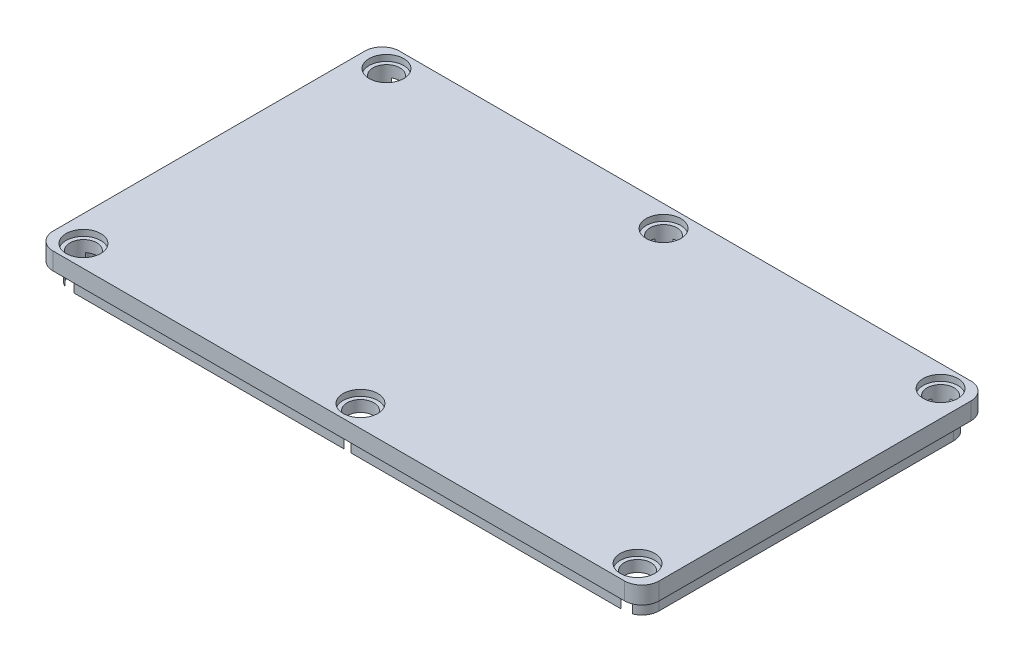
ISO-10303-21;
HEADER;
FILE_DESCRIPTION(('STEP AP214'),'2;1');
FILE_NAME('part.step','',(''),(''),'','','');
FILE_SCHEMA(('AUTOMOTIVE_DESIGN { 1 0 10303 214 1 1 1 1 }'));
ENDSEC;
DATA;
#1=APPLICATION_CONTEXT('core data for automotive mechanical design processes');
#2=APPLICATION_PROTOCOL_DEFINITION('international standard','automotive_design',2000,#1);
#3=PRODUCT_CONTEXT('',#1,'mechanical');
#4=PRODUCT('Part','Part','',(#3));
#5=PRODUCT_RELATED_PRODUCT_CATEGORY('part','',(#4));
#6=PRODUCT_DEFINITION_FORMATION('','',#4);
#7=PRODUCT_DEFINITION_CONTEXT('part definition',#1,'design');
#8=PRODUCT_DEFINITION('design','',#6,#7);
#9=PRODUCT_DEFINITION_SHAPE('','',#8);
#10=(LENGTH_UNIT() NAMED_UNIT(*) SI_UNIT(.MILLI.,.METRE.));
#11=(NAMED_UNIT(*) PLANE_ANGLE_UNIT() SI_UNIT($,.RADIAN.));
#12=(NAMED_UNIT(*) SI_UNIT($,.STERADIAN.) SOLID_ANGLE_UNIT());
#13=UNCERTAINTY_MEASURE_WITH_UNIT(LENGTH_MEASURE(1.E-05),#10,'distance_accuracy_value','');
#14=(GEOMETRIC_REPRESENTATION_CONTEXT(3) GLOBAL_UNCERTAINTY_ASSIGNED_CONTEXT((#13)) GLOBAL_UNIT_ASSIGNED_CONTEXT((#10,
#11,#12)) REPRESENTATION_CONTEXT('',''));
#15=CARTESIAN_POINT('',(0.,0.,0.));
#16=DIRECTION('',(0.,0.,1.));
#17=DIRECTION('',(1.,0.,0.));
#18=AXIS2_PLACEMENT_3D('',#15,#16,#17);
#19=CARTESIAN_POINT('',(32.,-2.,17.));
#20=DIRECTION('',(0.,-1.,0.));
#21=DIRECTION('',(0.,0.,-1.));
#22=AXIS2_PLACEMENT_3D('',#19,#20,#21);
#23=PLANE('',#22);
#24=CARTESIAN_POINT('',(0.,-2.,-17.5));
#25=DIRECTION('',(0.,-1.,0.));
#26=DIRECTION('',(0.,0.,-1.));
#27=AXIS2_PLACEMENT_3D('',#24,#25,#26);
#28=CIRCLE('',#27,1.55);
#29=CARTESIAN_POINT('',(0.390512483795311,-2.,-19.));
#30=VERTEX_POINT('',#29);
#31=CARTESIAN_POINT('',(1.46714007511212,-2.,-18.));
#32=VERTEX_POINT('',#31);
#33=EDGE_CURVE('E643',#30,#32,#28,.T.);
#34=ORIENTED_EDGE('',*,*,#33,.F.);
#35=DIRECTION('',(1.,0.,0.));
#36=VECTOR('',#35,1.);
#37=CARTESIAN_POINT('',(32.,-2.,-19.));
#38=LINE('',#37,#36);
#39=CARTESIAN_POINT('',(31.6094875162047,-2.,-19.));
#40=VERTEX_POINT('',#39);
#41=EDGE_CURVE('E357',#30,#40,#38,.T.);
#42=ORIENTED_EDGE('',*,*,#41,.T.);
#43=CARTESIAN_POINT('',(32.,-2.,-17.5));
#44=DIRECTION('',(0.,-1.,0.));
#45=DIRECTION('',(0.,0.,-1.));
#46=AXIS2_PLACEMENT_3D('',#43,#44,#45);
#47=CIRCLE('',#46,1.55);
#48=CARTESIAN_POINT('',(30.5328599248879,-2.,-18.));
#49=VERTEX_POINT('',#48);
#50=EDGE_CURVE('E657',#49,#40,#47,.T.);
#51=ORIENTED_EDGE('',*,*,#50,.F.);
#52=DIRECTION('',(1.,0.,0.));
#53=VECTOR('',#52,1.);
#54=CARTESIAN_POINT('',(31.,-2.,-18.));
#55=LINE('',#54,#53);
#56=EDGE_CURVE('E593',#32,#49,#55,.T.);
#57=ORIENTED_EDGE('',*,*,#56,.F.);
#58=EDGE_LOOP('',(#34,#42,#51,#57));
#59=FACE_BOUND('',#58,.T.);
#60=ADVANCED_FACE('F33',(#59),#23,.T.);
#61=CARTESIAN_POINT('',(0.,-2.,17.5));
#62=DIRECTION('',(0.,-1.,0.));
#63=DIRECTION('',(0.,0.,-1.));
#64=AXIS2_PLACEMENT_3D('',#61,#62,#63);
#65=CIRCLE('',#64,1.55);
#66=CARTESIAN_POINT('',(1.46714007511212,-2.,18.));
#67=VERTEX_POINT('',#66);
#68=CARTESIAN_POINT('',(0.390512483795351,-2.,19.));
#69=VERTEX_POINT('',#68);
#70=EDGE_CURVE('E503',#67,#69,#65,.T.);
#71=ORIENTED_EDGE('',*,*,#70,.F.);
#72=DIRECTION('',(-1.,0.,0.));
#73=VECTOR('',#72,1.);
#74=CARTESIAN_POINT('',(31.,-2.,18.));
#75=LINE('',#74,#73);
#76=CARTESIAN_POINT('',(30.5328599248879,-2.,18.));
#77=VERTEX_POINT('',#76);
#78=EDGE_CURVE('E585',#77,#67,#75,.T.);
#79=ORIENTED_EDGE('',*,*,#78,.F.);
#80=CARTESIAN_POINT('',(32.,-2.,17.5));
#81=DIRECTION('',(0.,-1.,0.));
#82=DIRECTION('',(0.,0.,-1.));
#83=AXIS2_PLACEMENT_3D('',#80,#81,#82);
#84=CIRCLE('',#83,1.55);
#85=CARTESIAN_POINT('',(31.6094875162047,-2.,19.));
#86=VERTEX_POINT('',#85);
#87=EDGE_CURVE('E485',#86,#77,#84,.T.);
#88=ORIENTED_EDGE('',*,*,#87,.F.);
#89=DIRECTION('',(-1.,0.,0.));
#90=VECTOR('',#89,1.);
#91=CARTESIAN_POINT('',(32.,-2.,19.));
#92=LINE('',#91,#90);
#93=EDGE_CURVE('E349',#86,#69,#92,.T.);
#94=ORIENTED_EDGE('',*,*,#93,.T.);
#95=EDGE_LOOP('',(#71,#79,#88,#94));
#96=FACE_BOUND('',#95,.T.);
#97=ADVANCED_FACE('F726',(#96),#23,.T.);
#98=CARTESIAN_POINT('',(32.7659920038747,-2.,-18.8475));
#99=VERTEX_POINT('',#98);
#100=CARTESIAN_POINT('',(32.9777774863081,-2.,-16.2973150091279));
#101=VERTEX_POINT('',#100);
#102=EDGE_CURVE('E658',#99,#101,#47,.T.);
#103=ORIENTED_EDGE('',*,*,#102,.F.);
#104=CARTESIAN_POINT('',(32.,-2.,-17.));
#105=DIRECTION('',(0.,-1.,0.));
#106=DIRECTION('',(0.,0.,-1.));
#107=AXIS2_PLACEMENT_3D('',#104,#105,#106);
#108=CIRCLE('',#107,2.);
#109=CARTESIAN_POINT('',(34.,-2.,-17.));
#110=VERTEX_POINT('',#109);
#111=EDGE_CURVE('E361',#99,#110,#108,.T.);
#112=ORIENTED_EDGE('',*,*,#111,.T.);
#113=DIRECTION('',(0.,0.,1.));
#114=VECTOR('',#113,1.);
#115=CARTESIAN_POINT('',(34.,-2.,-17.));
#116=LINE('',#115,#114);
#117=CARTESIAN_POINT('',(34.,-2.,17.));
#118=VERTEX_POINT('',#117);
#119=EDGE_CURVE('E363',#110,#118,#116,.T.);
#120=ORIENTED_EDGE('',*,*,#119,.T.);
#121=CARTESIAN_POINT('',(32.,-2.,17.));
#122=DIRECTION('',(0.,-1.,0.));
#123=DIRECTION('',(0.,0.,-1.));
#124=AXIS2_PLACEMENT_3D('',#121,#122,#123);
#125=CIRCLE('',#124,2.);
#126=CARTESIAN_POINT('',(32.7659920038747,-2.,18.8475));
#127=VERTEX_POINT('',#126);
#128=EDGE_CURVE('E343',#118,#127,#125,.T.);
#129=ORIENTED_EDGE('',*,*,#128,.T.);
#130=CARTESIAN_POINT('',(32.9777774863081,-2.,16.2973150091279));
#131=VERTEX_POINT('',#130);
#132=EDGE_CURVE('E487',#131,#127,#84,.T.);
#133=ORIENTED_EDGE('',*,*,#132,.F.);
#134=CARTESIAN_POINT('',(31.,-2.,16.));
#135=DIRECTION('',(0.,-1.,0.));
#136=DIRECTION('',(0.,0.,1.));
#137=AXIS2_PLACEMENT_3D('',#134,#135,#136);
#138=CIRCLE('',#137,2.);
#139=CARTESIAN_POINT('',(33.,-2.,16.));
#140=VERTEX_POINT('',#139);
#141=EDGE_CURVE('E328',#140,#131,#138,.T.);
#142=ORIENTED_EDGE('',*,*,#141,.F.);
#143=DIRECTION('',(0.,0.,1.));
#144=VECTOR('',#143,1.);
#145=CARTESIAN_POINT('',(33.,-2.,-16.));
#146=LINE('',#145,#144);
#147=CARTESIAN_POINT('',(33.,-2.,-16.));
#148=VERTEX_POINT('',#147);
#149=EDGE_CURVE('E333',#148,#140,#146,.T.);
#150=ORIENTED_EDGE('',*,*,#149,.F.);
#151=CARTESIAN_POINT('',(31.,-2.,-16.));
#152=DIRECTION('',(0.,-1.,0.));
#153=DIRECTION('',(0.,0.,-1.));
#154=AXIS2_PLACEMENT_3D('',#151,#152,#153);
#155=CIRCLE('',#154,2.);
#156=EDGE_CURVE('E595',#101,#148,#155,.T.);
#157=ORIENTED_EDGE('',*,*,#156,.F.);
#158=EDGE_LOOP('',(#103,#112,#120,#129,#133,#142,#150,#157));
#159=FACE_BOUND('',#158,.T.);
#160=ADVANCED_FACE('F674',(#159),#23,.T.);
#161=CARTESIAN_POINT('',(-1.46714007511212,-2.,-18.));
#162=VERTEX_POINT('',#161);
#163=CARTESIAN_POINT('',(-0.390512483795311,-2.,-19.));
#164=VERTEX_POINT('',#163);
#165=EDGE_CURVE('E642',#162,#164,#28,.T.);
#166=ORIENTED_EDGE('',*,*,#165,.F.);
#167=CARTESIAN_POINT('',(-30.5328599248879,-2.,-18.));
#168=VERTEX_POINT('',#167);
#169=EDGE_CURVE('E312',#168,#162,#55,.T.);
#170=ORIENTED_EDGE('',*,*,#169,.F.);
#171=CARTESIAN_POINT('',(-32.,-2.,-17.5));
#172=DIRECTION('',(0.,-1.,0.));
#173=DIRECTION('',(0.,0.,-1.));
#174=AXIS2_PLACEMENT_3D('',#171,#172,#173);
#175=CIRCLE('',#174,1.55);
#176=CARTESIAN_POINT('',(-31.6094875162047,-2.,-19.));
#177=VERTEX_POINT('',#176);
#178=EDGE_CURVE('E535',#177,#168,#175,.T.);
#179=ORIENTED_EDGE('',*,*,#178,.F.);
#180=EDGE_CURVE('E358',#177,#164,#38,.T.);
#181=ORIENTED_EDGE('',*,*,#180,.T.);
#182=EDGE_LOOP('',(#166,#170,#179,#181));
#183=FACE_BOUND('',#182,.T.);
#184=ADVANCED_FACE('F641',(#183),#23,.T.);
#185=CARTESIAN_POINT('',(32.,-2.,19.));
#186=DIRECTION('',(0.,0.,-1.));
#187=DIRECTION('',(-1.,0.,0.));
#188=AXIS2_PLACEMENT_3D('',#185,#186,#187);
#189=PLANE('',#188);
#190=CARTESIAN_POINT('',(-0.390512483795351,-2.,19.));
#191=VERTEX_POINT('',#190);
#192=CARTESIAN_POINT('',(-31.6094875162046,-2.,19.));
#193=VERTEX_POINT('',#192);
#194=EDGE_CURVE('E346',#191,#193,#92,.T.);
#195=ORIENTED_EDGE('',*,*,#194,.F.);
#196=DIRECTION('',(0.,1.,0.));
#197=VECTOR('',#196,1.);
#198=CARTESIAN_POINT('',(-0.390512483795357,-5.,19.));
#199=LINE('',#198,#197);
#200=CARTESIAN_POINT('',(-0.390512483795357,0.,19.));
#201=VERTEX_POINT('',#200);
#202=EDGE_CURVE('E507',#191,#201,#199,.T.);
#203=ORIENTED_EDGE('',*,*,#202,.T.);
#204=DIRECTION('',(-1.,0.,0.));
#205=VECTOR('',#204,1.);
#206=CARTESIAN_POINT('',(32.,0.,19.));
#207=LINE('',#206,#205);
#208=CARTESIAN_POINT('',(-31.6094875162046,0.,19.));
#209=VERTEX_POINT('',#208);
#210=EDGE_CURVE('E368',#201,#209,#207,.T.);
#211=ORIENTED_EDGE('',*,*,#210,.T.);
#212=DIRECTION('',(0.,1.,0.));
#213=VECTOR('',#212,1.);
#214=CARTESIAN_POINT('',(-31.6094875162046,-5.,19.));
#215=LINE('',#214,#213);
#216=EDGE_CURVE('E524',#209,#193,#215,.F.);
#217=ORIENTED_EDGE('',*,*,#216,.T.);
#218=EDGE_LOOP('',(#195,#203,#211,#217));
#219=FACE_BOUND('',#218,.T.);
#220=ADVANCED_FACE('F748',(#219),#189,.F.);
#221=CARTESIAN_POINT('',(32.,-2.,-19.));
#222=DIRECTION('',(0.,0.,1.));
#223=DIRECTION('',(1.,0.,0.));
#224=AXIS2_PLACEMENT_3D('',#221,#222,#223);
#225=PLANE('',#224);
#226=ORIENTED_EDGE('',*,*,#41,.F.);
#227=DIRECTION('',(0.,1.,0.));
#228=VECTOR('',#227,1.);
#229=CARTESIAN_POINT('',(0.390512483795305,-5.,-19.));
#230=LINE('',#229,#228);
#231=CARTESIAN_POINT('',(0.390512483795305,0.,-19.));
#232=VERTEX_POINT('',#231);
#233=EDGE_CURVE('E648',#30,#232,#230,.T.);
#234=ORIENTED_EDGE('',*,*,#233,.T.);
#235=DIRECTION('',(1.,0.,0.));
#236=VECTOR('',#235,1.);
#237=CARTESIAN_POINT('',(32.,0.,-19.));
#238=LINE('',#237,#236);
#239=CARTESIAN_POINT('',(31.6094875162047,0.,-19.));
#240=VERTEX_POINT('',#239);
#241=EDGE_CURVE('E378',#232,#240,#238,.T.);
#242=ORIENTED_EDGE('',*,*,#241,.T.);
#243=DIRECTION('',(0.,1.,0.));
#244=VECTOR('',#243,1.);
#245=CARTESIAN_POINT('',(31.6094875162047,-5.,-19.));
#246=LINE('',#245,#244);
#247=EDGE_CURVE('E472',#240,#40,#246,.F.);
#248=ORIENTED_EDGE('',*,*,#247,.T.);
#249=EDGE_LOOP('',(#226,#234,#242,#248));
#250=FACE_BOUND('',#249,.T.);
#251=ADVANCED_FACE('F699',(#250),#225,.F.);
#252=CARTESIAN_POINT('',(31.,-2.,18.));
#253=DIRECTION('',(0.,0.,-1.));
#254=DIRECTION('',(-1.,0.,0.));
#255=AXIS2_PLACEMENT_3D('',#252,#253,#254);
#256=PLANE('',#255);
#257=DIRECTION('',(0.,1.,0.));
#258=VECTOR('',#257,1.);
#259=CARTESIAN_POINT('',(-1.46714007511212,-5.,18.));
#260=LINE('',#259,#258);
#261=CARTESIAN_POINT('',(-1.46714007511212,-2.,18.));
#262=VERTEX_POINT('',#261);
#263=CARTESIAN_POINT('',(-1.46714007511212,0.,18.));
#264=VERTEX_POINT('',#263);
#265=EDGE_CURVE('E50',#262,#264,#260,.T.);
#266=ORIENTED_EDGE('',*,*,#265,.F.);
#267=CARTESIAN_POINT('',(-30.5328599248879,-2.,18.));
#268=VERTEX_POINT('',#267);
#269=EDGE_CURVE('E583',#262,#268,#75,.T.);
#270=ORIENTED_EDGE('',*,*,#269,.T.);
#271=DIRECTION('',(0.,1.,0.));
#272=VECTOR('',#271,1.);
#273=CARTESIAN_POINT('',(-30.5328599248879,-5.,18.));
#274=LINE('',#273,#272);
#275=CARTESIAN_POINT('',(-30.5328599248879,0.,18.));
#276=VERTEX_POINT('',#275);
#277=EDGE_CURVE('E515',#276,#268,#274,.F.);
#278=ORIENTED_EDGE('',*,*,#277,.F.);
#279=DIRECTION('',(-1.,0.,0.));
#280=VECTOR('',#279,1.);
#281=CARTESIAN_POINT('',(31.,0.,18.));
#282=LINE('',#281,#280);
#283=EDGE_CURVE('E600',#264,#276,#282,.T.);
#284=ORIENTED_EDGE('',*,*,#283,.F.);
#285=EDGE_LOOP('',(#266,#270,#278,#284));
#286=FACE_BOUND('',#285,.T.);
#287=ADVANCED_FACE('F735',(#286),#256,.T.);
#288=CARTESIAN_POINT('',(31.,-2.,-18.));
#289=DIRECTION('',(0.,0.,1.));
#290=DIRECTION('',(1.,0.,0.));
#291=AXIS2_PLACEMENT_3D('',#288,#289,#290);
#292=PLANE('',#291);
#293=DIRECTION('',(0.,1.,0.));
#294=VECTOR('',#293,1.);
#295=CARTESIAN_POINT('',(1.46714007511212,-5.,-18.));
#296=LINE('',#295,#294);
#297=CARTESIAN_POINT('',(1.46714007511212,0.,-18.));
#298=VERTEX_POINT('',#297);
#299=EDGE_CURVE('E298',#32,#298,#296,.T.);
#300=ORIENTED_EDGE('',*,*,#299,.F.);
#301=ORIENTED_EDGE('',*,*,#56,.T.);
#302=DIRECTION('',(0.,1.,0.));
#303=VECTOR('',#302,1.);
#304=CARTESIAN_POINT('',(30.5328599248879,-5.,-18.));
#305=LINE('',#304,#303);
#306=CARTESIAN_POINT('',(30.5328599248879,0.,-18.));
#307=VERTEX_POINT('',#306);
#308=EDGE_CURVE('E655',#307,#49,#305,.F.);
#309=ORIENTED_EDGE('',*,*,#308,.F.);
#310=DIRECTION('',(1.,0.,0.));
#311=VECTOR('',#310,1.);
#312=CARTESIAN_POINT('',(31.,0.,-18.));
#313=LINE('',#312,#311);
#314=EDGE_CURVE('E319',#298,#307,#313,.T.);
#315=ORIENTED_EDGE('',*,*,#314,.F.);
#316=EDGE_LOOP('',(#300,#301,#309,#315));
#317=FACE_BOUND('',#316,.T.);
#318=ADVANCED_FACE('F691',(#317),#292,.T.);
#319=EDGE_CURVE('E501',#191,#262,#65,.T.);
#320=ORIENTED_EDGE('',*,*,#319,.F.);
#321=ORIENTED_EDGE('',*,*,#194,.T.);
#322=CARTESIAN_POINT('',(-32.,-2.,17.5));
#323=DIRECTION('',(0.,-1.,0.));
#324=DIRECTION('',(0.,0.,-1.));
#325=AXIS2_PLACEMENT_3D('',#322,#323,#324);
#326=CIRCLE('',#325,1.55);
#327=EDGE_CURVE('E520',#268,#193,#326,.T.);
#328=ORIENTED_EDGE('',*,*,#327,.F.);
#329=ORIENTED_EDGE('',*,*,#269,.F.);
#330=EDGE_LOOP('',(#320,#321,#328,#329));
#331=FACE_BOUND('',#330,.T.);
#332=ADVANCED_FACE('F745',(#331),#23,.T.);
#333=CARTESIAN_POINT('',(-33.,0.,18.));
#334=DIRECTION('',(0.,-1.,0.));
#335=DIRECTION('',(0.,0.,-1.));
#336=AXIS2_PLACEMENT_3D('',#333,#334,#335);
#337=PLANE('',#336);
#338=CARTESIAN_POINT('',(0.,0.,-17.5));
#339=DIRECTION('',(0.,-1.,0.));
#340=DIRECTION('',(0.,0.,-1.));
#341=AXIS2_PLACEMENT_3D('',#338,#339,#340);
#342=CIRCLE('',#341,1.55);
#343=CARTESIAN_POINT('',(-0.390512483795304,0.,-19.));
#344=VERTEX_POINT('',#343);
#345=EDGE_CURVE('E464',#344,#232,#342,.T.);
#346=ORIENTED_EDGE('',*,*,#345,.F.);
#347=CARTESIAN_POINT('',(-31.6094875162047,0.,-19.));
#348=VERTEX_POINT('',#347);
#349=EDGE_CURVE('E379',#348,#344,#238,.T.);
#350=ORIENTED_EDGE('',*,*,#349,.F.);
#351=CARTESIAN_POINT('',(-32.,0.,-17.5));
#352=DIRECTION('',(0.,-1.,0.));
#353=DIRECTION('',(0.,0.,-1.));
#354=AXIS2_PLACEMENT_3D('',#351,#352,#353);
#355=CIRCLE('',#354,1.55);
#356=CARTESIAN_POINT('',(-32.7659920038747,0.,-18.8475));
#357=VERTEX_POINT('',#356);
#358=EDGE_CURVE('E542',#357,#348,#355,.T.);
#359=ORIENTED_EDGE('',*,*,#358,.F.);
#360=CARTESIAN_POINT('',(-32.,0.,-17.));
#361=DIRECTION('',(0.,-1.,0.));
#362=DIRECTION('',(0.,0.,1.));
#363=AXIS2_PLACEMENT_3D('',#360,#361,#362);
#364=CIRCLE('',#363,2.);
#365=CARTESIAN_POINT('',(-34.,0.,-17.));
#366=VERTEX_POINT('',#365);
#367=EDGE_CURVE('E375',#366,#357,#364,.T.);
#368=ORIENTED_EDGE('',*,*,#367,.F.);
#369=DIRECTION('',(0.,0.,-1.));
#370=VECTOR('',#369,1.);
#371=CARTESIAN_POINT('',(-34.,0.,-17.));
#372=LINE('',#371,#370);
#373=CARTESIAN_POINT('',(-34.,0.,17.));
#374=VERTEX_POINT('',#373);
#375=EDGE_CURVE('E373',#374,#366,#372,.T.);
#376=ORIENTED_EDGE('',*,*,#375,.F.);
#377=CARTESIAN_POINT('',(-32.,0.,17.));
#378=DIRECTION('',(0.,-1.,0.));
#379=DIRECTION('',(0.,0.,-1.));
#380=AXIS2_PLACEMENT_3D('',#377,#378,#379);
#381=CIRCLE('',#380,2.);
#382=CARTESIAN_POINT('',(-32.7659920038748,0.,18.8475));
#383=VERTEX_POINT('',#382);
#384=EDGE_CURVE('E371',#383,#374,#381,.T.);
#385=ORIENTED_EDGE('',*,*,#384,.F.);
#386=CARTESIAN_POINT('',(-32.,0.,17.5));
#387=DIRECTION('',(0.,-1.,0.));
#388=DIRECTION('',(0.,0.,-1.));
#389=AXIS2_PLACEMENT_3D('',#386,#387,#388);
#390=CIRCLE('',#389,1.55);
#391=EDGE_CURVE('E453',#209,#383,#390,.T.);
#392=ORIENTED_EDGE('',*,*,#391,.F.);
#393=ORIENTED_EDGE('',*,*,#210,.F.);
#394=CARTESIAN_POINT('',(0.,0.,17.5));
#395=DIRECTION('',(0.,-1.,0.));
#396=DIRECTION('',(0.,0.,-1.));
#397=AXIS2_PLACEMENT_3D('',#394,#395,#396);
#398=CIRCLE('',#397,1.55);
#399=CARTESIAN_POINT('',(0.390512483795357,0.,19.));
#400=VERTEX_POINT('',#399);
#401=EDGE_CURVE('E458',#400,#201,#398,.T.);
#402=ORIENTED_EDGE('',*,*,#401,.F.);
#403=CARTESIAN_POINT('',(31.6094875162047,0.,19.));
#404=VERTEX_POINT('',#403);
#405=EDGE_CURVE('E370',#404,#400,#207,.T.);
#406=ORIENTED_EDGE('',*,*,#405,.F.);
#407=CARTESIAN_POINT('',(32.,0.,17.5));
#408=DIRECTION('',(0.,-1.,0.));
#409=DIRECTION('',(0.,0.,-1.));
#410=AXIS2_PLACEMENT_3D('',#407,#408,#409);
#411=CIRCLE('',#410,1.55);
#412=CARTESIAN_POINT('',(32.7659920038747,0.,18.8475));
#413=VERTEX_POINT('',#412);
#414=EDGE_CURVE('E494',#413,#404,#411,.T.);
#415=ORIENTED_EDGE('',*,*,#414,.F.);
#416=CARTESIAN_POINT('',(32.,0.,17.));
#417=DIRECTION('',(0.,-1.,0.));
#418=DIRECTION('',(0.,0.,-1.));
#419=AXIS2_PLACEMENT_3D('',#416,#417,#418);
#420=CIRCLE('',#419,2.);
#421=CARTESIAN_POINT('',(34.,0.,17.));
#422=VERTEX_POINT('',#421);
#423=EDGE_CURVE('E342',#422,#413,#420,.T.);
#424=ORIENTED_EDGE('',*,*,#423,.F.);
#425=DIRECTION('',(0.,0.,1.));
#426=VECTOR('',#425,1.);
#427=CARTESIAN_POINT('',(34.,0.,-17.));
#428=LINE('',#427,#426);
#429=CARTESIAN_POINT('',(34.,0.,-17.));
#430=VERTEX_POINT('',#429);
#431=EDGE_CURVE('E347',#430,#422,#428,.T.);
#432=ORIENTED_EDGE('',*,*,#431,.F.);
#433=CARTESIAN_POINT('',(32.,0.,-17.));
#434=DIRECTION('',(0.,-1.,0.));
#435=DIRECTION('',(0.,0.,-1.));
#436=AXIS2_PLACEMENT_3D('',#433,#434,#435);
#437=CIRCLE('',#436,2.);
#438=CARTESIAN_POINT('',(32.7659920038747,0.,-18.8475));
#439=VERTEX_POINT('',#438);
#440=EDGE_CURVE('E382',#439,#430,#437,.T.);
#441=ORIENTED_EDGE('',*,*,#440,.F.);
#442=CARTESIAN_POINT('',(32.,0.,-17.5));
#443=DIRECTION('',(0.,-1.,0.));
#444=DIRECTION('',(0.,0.,-1.));
#445=AXIS2_PLACEMENT_3D('',#442,#443,#444);
#446=CIRCLE('',#445,1.55);
#447=EDGE_CURVE('E468',#240,#439,#446,.T.);
#448=ORIENTED_EDGE('',*,*,#447,.F.);
#449=ORIENTED_EDGE('',*,*,#241,.F.);
#450=EDGE_LOOP('',(#346,#350,#359,#368,#376,#385,#392,#393,#402,#406,#415,#424,#432,#441,#448,#449));
#451=FACE_BOUND('',#450,.T.);
#452=CARTESIAN_POINT('',(-33.,0.,18.));
#453=DIRECTION('',(0.,1.,0.));
#454=DIRECTION('',(0.,0.,-1.));
#455=AXIS2_PLACEMENT_3D('',#452,#453,#454);
#456=CIRCLE('',#455,2.);
#457=CARTESIAN_POINT('',(-35.,0.,18.));
#458=VERTEX_POINT('',#457);
#459=CARTESIAN_POINT('',(-33.,0.,20.));
#460=VERTEX_POINT('',#459);
#461=EDGE_CURVE('E396',#458,#460,#456,.T.);
#462=ORIENTED_EDGE('',*,*,#461,.F.);
#463=DIRECTION('',(0.,0.,1.));
#464=VECTOR('',#463,1.);
#465=CARTESIAN_POINT('',(-35.,0.,18.));
#466=LINE('',#465,#464);
#467=CARTESIAN_POINT('',(-35.,0.,-18.));
#468=VERTEX_POINT('',#467);
#469=EDGE_CURVE('E401',#468,#458,#466,.T.);
#470=ORIENTED_EDGE('',*,*,#469,.F.);
#471=CARTESIAN_POINT('',(-33.,0.,-18.));
#472=DIRECTION('',(0.,1.,0.));
#473=DIRECTION('',(0.,0.,-1.));
#474=AXIS2_PLACEMENT_3D('',#471,#472,#473);
#475=CIRCLE('',#474,2.);
#476=CARTESIAN_POINT('',(-33.,0.,-20.));
#477=VERTEX_POINT('',#476);
#478=EDGE_CURVE('E428',#477,#468,#475,.T.);
#479=ORIENTED_EDGE('',*,*,#478,.F.);
#480=DIRECTION('',(-1.,0.,0.));
#481=VECTOR('',#480,1.);
#482=CARTESIAN_POINT('',(-33.,0.,-20.));
#483=LINE('',#482,#481);
#484=CARTESIAN_POINT('',(33.,0.,-20.));
#485=VERTEX_POINT('',#484);
#486=EDGE_CURVE('E426',#485,#477,#483,.T.);
#487=ORIENTED_EDGE('',*,*,#486,.F.);
#488=CARTESIAN_POINT('',(33.,0.,-18.));
#489=DIRECTION('',(0.,1.,0.));
#490=DIRECTION('',(0.,0.,-1.));
#491=AXIS2_PLACEMENT_3D('',#488,#489,#490);
#492=CIRCLE('',#491,2.);
#493=CARTESIAN_POINT('',(35.,0.,-18.));
#494=VERTEX_POINT('',#493);
#495=EDGE_CURVE('E424',#494,#485,#492,.T.);
#496=ORIENTED_EDGE('',*,*,#495,.F.);
#497=DIRECTION('',(0.,0.,-1.));
#498=VECTOR('',#497,1.);
#499=CARTESIAN_POINT('',(35.,0.,18.));
#500=LINE('',#499,#498);
#501=CARTESIAN_POINT('',(35.,0.,18.));
#502=VERTEX_POINT('',#501);
#503=EDGE_CURVE('E422',#502,#494,#500,.T.);
#504=ORIENTED_EDGE('',*,*,#503,.F.);
#505=CARTESIAN_POINT('',(33.,0.,18.));
#506=DIRECTION('',(0.,1.,0.));
#507=DIRECTION('',(0.,0.,1.));
#508=AXIS2_PLACEMENT_3D('',#505,#506,#507);
#509=CIRCLE('',#508,2.);
#510=CARTESIAN_POINT('',(33.,0.,20.));
#511=VERTEX_POINT('',#510);
#512=EDGE_CURVE('E420',#511,#502,#509,.T.);
#513=ORIENTED_EDGE('',*,*,#512,.F.);
#514=DIRECTION('',(1.,0.,0.));
#515=VECTOR('',#514,1.);
#516=CARTESIAN_POINT('',(-33.,0.,20.));
#517=LINE('',#516,#515);
#518=EDGE_CURVE('E418',#460,#511,#517,.T.);
#519=ORIENTED_EDGE('',*,*,#518,.F.);
#520=EDGE_LOOP('',(#462,#470,#479,#487,#496,#504,#513,#519));
#521=FACE_BOUND('',#520,.T.);
#522=ADVANCED_FACE('F630',(#451,#521),#337,.T.);
#523=CARTESIAN_POINT('',(-33.,2.,18.));
#524=DIRECTION('',(0.,-1.,0.));
#525=DIRECTION('',(0.,0.,-1.));
#526=AXIS2_PLACEMENT_3D('',#523,#524,#525);
#527=CYLINDRICAL_SURFACE('',#526,2.);
#528=ORIENTED_EDGE('',*,*,#461,.T.);
#529=DIRECTION('',(0.,-1.,0.));
#530=VECTOR('',#529,1.);
#531=CARTESIAN_POINT('',(-33.,2.,20.));
#532=LINE('',#531,#530);
#533=CARTESIAN_POINT('',(-33.,2.,20.));
#534=VERTEX_POINT('',#533);
#535=EDGE_CURVE('E11',#534,#460,#532,.T.);
#536=ORIENTED_EDGE('',*,*,#535,.F.);
#537=CARTESIAN_POINT('',(-33.,2.,18.));
#538=DIRECTION('',(0.,1.,0.));
#539=DIRECTION('',(0.,0.,-1.));
#540=AXIS2_PLACEMENT_3D('',#537,#538,#539);
#541=CIRCLE('',#540,2.);
#542=CARTESIAN_POINT('',(-35.,2.,18.));
#543=VERTEX_POINT('',#542);
#544=EDGE_CURVE('E397',#543,#534,#541,.T.);
#545=ORIENTED_EDGE('',*,*,#544,.F.);
#546=DIRECTION('',(0.,-1.,0.));
#547=VECTOR('',#546,1.);
#548=CARTESIAN_POINT('',(-35.,2.,18.));
#549=LINE('',#548,#547);
#550=EDGE_CURVE('E415',#543,#458,#549,.T.);
#551=ORIENTED_EDGE('',*,*,#550,.T.);
#552=EDGE_LOOP('',(#528,#536,#545,#551));
#553=FACE_BOUND('',#552,.T.);
#554=ADVANCED_FACE('F35',(#553),#527,.T.);
#555=CARTESIAN_POINT('',(-33.,2.,20.));
#556=DIRECTION('',(0.,0.,-1.));
#557=DIRECTION('',(-1.,0.,0.));
#558=AXIS2_PLACEMENT_3D('',#555,#556,#557);
#559=PLANE('',#558);
#560=ORIENTED_EDGE('',*,*,#518,.T.);
#561=DIRECTION('',(0.,-1.,0.));
#562=VECTOR('',#561,1.);
#563=CARTESIAN_POINT('',(33.,2.,20.));
#564=LINE('',#563,#562);
#565=CARTESIAN_POINT('',(33.,2.,20.));
#566=VERTEX_POINT('',#565);
#567=EDGE_CURVE('E42',#566,#511,#564,.T.);
#568=ORIENTED_EDGE('',*,*,#567,.F.);
#569=DIRECTION('',(1.,0.,0.));
#570=VECTOR('',#569,1.);
#571=CARTESIAN_POINT('',(-33.,2.,20.));
#572=LINE('',#571,#570);
#573=EDGE_CURVE('E400',#534,#566,#572,.T.);
#574=ORIENTED_EDGE('',*,*,#573,.F.);
#575=ORIENTED_EDGE('',*,*,#535,.T.);
#576=EDGE_LOOP('',(#560,#568,#574,#575));
#577=FACE_BOUND('',#576,.T.);
#578=ADVANCED_FACE('F1025',(#577),#559,.F.);
#579=CARTESIAN_POINT('',(33.,2.,18.));
#580=DIRECTION('',(0.,-1.,0.));
#581=DIRECTION('',(0.,0.,-1.));
#582=AXIS2_PLACEMENT_3D('',#579,#580,#581);
#583=CYLINDRICAL_SURFACE('',#582,2.);
#584=ORIENTED_EDGE('',*,*,#512,.T.);
#585=DIRECTION('',(0.,-1.,0.));
#586=VECTOR('',#585,1.);
#587=CARTESIAN_POINT('',(35.,2.,18.));
#588=LINE('',#587,#586);
#589=CARTESIAN_POINT('',(35.,2.,18.));
#590=VERTEX_POINT('',#589);
#591=EDGE_CURVE('E445',#590,#502,#588,.T.);
#592=ORIENTED_EDGE('',*,*,#591,.F.);
#593=CARTESIAN_POINT('',(33.,2.,18.));
#594=DIRECTION('',(0.,1.,0.));
#595=DIRECTION('',(0.,0.,1.));
#596=AXIS2_PLACEMENT_3D('',#593,#594,#595);
#597=CIRCLE('',#596,2.);
#598=EDGE_CURVE('E403',#566,#590,#597,.T.);
#599=ORIENTED_EDGE('',*,*,#598,.F.);
#600=ORIENTED_EDGE('',*,*,#567,.T.);
#601=EDGE_LOOP('',(#584,#592,#599,#600));
#602=FACE_BOUND('',#601,.T.);
#603=ADVANCED_FACE('F1015',(#602),#583,.T.);
#604=CARTESIAN_POINT('',(35.,2.,18.));
#605=DIRECTION('',(-1.,0.,0.));
#606=DIRECTION('',(0.,0.,1.));
#607=AXIS2_PLACEMENT_3D('',#604,#605,#606);
#608=PLANE('',#607);
#609=ORIENTED_EDGE('',*,*,#503,.T.);
#610=DIRECTION('',(0.,-1.,0.));
#611=VECTOR('',#610,1.);
#612=CARTESIAN_POINT('',(35.,2.,-18.));
#613=LINE('',#612,#611);
#614=CARTESIAN_POINT('',(35.,2.,-18.));
#615=VERTEX_POINT('',#614);
#616=EDGE_CURVE('E442',#615,#494,#613,.T.);
#617=ORIENTED_EDGE('',*,*,#616,.F.);
#618=DIRECTION('',(0.,0.,-1.));
#619=VECTOR('',#618,1.);
#620=CARTESIAN_POINT('',(35.,2.,18.));
#621=LINE('',#620,#619);
#622=EDGE_CURVE('E405',#590,#615,#621,.T.);
#623=ORIENTED_EDGE('',*,*,#622,.F.);
#624=ORIENTED_EDGE('',*,*,#591,.T.);
#625=EDGE_LOOP('',(#609,#617,#623,#624));
#626=FACE_BOUND('',#625,.T.);
#627=ADVANCED_FACE('F1005',(#626),#608,.F.);
#628=CARTESIAN_POINT('',(33.,2.,-18.));
#629=DIRECTION('',(0.,-1.,0.));
#630=DIRECTION('',(0.,0.,-1.));
#631=AXIS2_PLACEMENT_3D('',#628,#629,#630);
#632=CYLINDRICAL_SURFACE('',#631,2.);
#633=ORIENTED_EDGE('',*,*,#495,.T.);
#634=DIRECTION('',(0.,-1.,0.));
#635=VECTOR('',#634,1.);
#636=CARTESIAN_POINT('',(33.,2.,-20.));
#637=LINE('',#636,#635);
#638=CARTESIAN_POINT('',(33.,2.,-20.));
#639=VERTEX_POINT('',#638);
#640=EDGE_CURVE('E439',#639,#485,#637,.T.);
#641=ORIENTED_EDGE('',*,*,#640,.F.);
#642=CARTESIAN_POINT('',(33.,2.,-18.));
#643=DIRECTION('',(0.,1.,0.));
#644=DIRECTION('',(0.,0.,-1.));
#645=AXIS2_PLACEMENT_3D('',#642,#643,#644);
#646=CIRCLE('',#645,2.);
#647=EDGE_CURVE('E407',#615,#639,#646,.T.);
#648=ORIENTED_EDGE('',*,*,#647,.F.);
#649=ORIENTED_EDGE('',*,*,#616,.T.);
#650=EDGE_LOOP('',(#633,#641,#648,#649));
#651=FACE_BOUND('',#650,.T.);
#652=ADVANCED_FACE('F995',(#651),#632,.T.);
#653=CARTESIAN_POINT('',(-33.,2.,-20.));
#654=DIRECTION('',(0.,0.,1.));
#655=DIRECTION('',(1.,0.,0.));
#656=AXIS2_PLACEMENT_3D('',#653,#654,#655);
#657=PLANE('',#656);
#658=ORIENTED_EDGE('',*,*,#486,.T.);
#659=DIRECTION('',(0.,-1.,0.));
#660=VECTOR('',#659,1.);
#661=CARTESIAN_POINT('',(-33.,2.,-20.));
#662=LINE('',#661,#660);
#663=CARTESIAN_POINT('',(-33.,2.,-20.));
#664=VERTEX_POINT('',#663);
#665=EDGE_CURVE('E436',#664,#477,#662,.T.);
#666=ORIENTED_EDGE('',*,*,#665,.F.);
#667=DIRECTION('',(-1.,0.,0.));
#668=VECTOR('',#667,1.);
#669=CARTESIAN_POINT('',(-33.,2.,-20.));
#670=LINE('',#669,#668);
#671=EDGE_CURVE('E409',#639,#664,#670,.T.);
#672=ORIENTED_EDGE('',*,*,#671,.F.);
#673=ORIENTED_EDGE('',*,*,#640,.T.);
#674=EDGE_LOOP('',(#658,#666,#672,#673));
#675=FACE_BOUND('',#674,.T.);
#676=ADVANCED_FACE('F985',(#675),#657,.F.);
#677=CARTESIAN_POINT('',(-33.,2.,-18.));
#678=DIRECTION('',(0.,-1.,0.));
#679=DIRECTION('',(0.,0.,-1.));
#680=AXIS2_PLACEMENT_3D('',#677,#678,#679);
#681=CYLINDRICAL_SURFACE('',#680,2.);
#682=ORIENTED_EDGE('',*,*,#478,.T.);
#683=DIRECTION('',(0.,-1.,0.));
#684=VECTOR('',#683,1.);
#685=CARTESIAN_POINT('',(-35.,2.,-18.));
#686=LINE('',#685,#684);
#687=CARTESIAN_POINT('',(-35.,2.,-18.));
#688=VERTEX_POINT('',#687);
#689=EDGE_CURVE('E433',#688,#468,#686,.T.);
#690=ORIENTED_EDGE('',*,*,#689,.F.);
#691=CARTESIAN_POINT('',(-33.,2.,-18.));
#692=DIRECTION('',(0.,1.,0.));
#693=DIRECTION('',(0.,0.,-1.));
#694=AXIS2_PLACEMENT_3D('',#691,#692,#693);
#695=CIRCLE('',#694,2.);
#696=EDGE_CURVE('E411',#664,#688,#695,.T.);
#697=ORIENTED_EDGE('',*,*,#696,.F.);
#698=ORIENTED_EDGE('',*,*,#665,.T.);
#699=EDGE_LOOP('',(#682,#690,#697,#698));
#700=FACE_BOUND('',#699,.T.);
#701=ADVANCED_FACE('F975',(#700),#681,.T.);
#702=CARTESIAN_POINT('',(-35.,2.,18.));
#703=DIRECTION('',(1.,0.,0.));
#704=DIRECTION('',(0.,0.,-1.));
#705=AXIS2_PLACEMENT_3D('',#702,#703,#704);
#706=PLANE('',#705);
#707=ORIENTED_EDGE('',*,*,#469,.T.);
#708=ORIENTED_EDGE('',*,*,#550,.F.);
#709=DIRECTION('',(0.,0.,1.));
#710=VECTOR('',#709,1.);
#711=CARTESIAN_POINT('',(-35.,2.,18.));
#712=LINE('',#711,#710);
#713=EDGE_CURVE('E413',#688,#543,#712,.T.);
#714=ORIENTED_EDGE('',*,*,#713,.F.);
#715=ORIENTED_EDGE('',*,*,#689,.T.);
#716=EDGE_LOOP('',(#707,#708,#714,#715));
#717=FACE_BOUND('',#716,.T.);
#718=ADVANCED_FACE('F779',(#717),#706,.F.);
#719=CARTESIAN_POINT('',(-33.,2.,18.));
#720=DIRECTION('',(0.,-1.,0.));
#721=DIRECTION('',(0.,0.,-1.));
#722=AXIS2_PLACEMENT_3D('',#719,#720,#721);
#723=PLANE('',#722);
#724=CARTESIAN_POINT('',(0.,2.,-17.5));
#725=DIRECTION('',(0.,1.,0.));
#726=DIRECTION('',(0.,0.,1.));
#727=AXIS2_PLACEMENT_3D('',#724,#725,#726);
#728=CIRCLE('',#727,2.);
#729=CARTESIAN_POINT('',(0.,2.,-15.5));
#730=VERTEX_POINT('',#729);
#731=EDGE_CURVE('E549',#730,#730,#728,.T.);
#732=ORIENTED_EDGE('',*,*,#731,.F.);
#733=EDGE_LOOP('',(#732));
#734=FACE_BOUND('',#733,.T.);
#735=CARTESIAN_POINT('',(32.,2.,-17.5));
#736=DIRECTION('',(0.,1.,0.));
#737=DIRECTION('',(0.,0.,1.));
#738=AXIS2_PLACEMENT_3D('',#735,#736,#737);
#739=CIRCLE('',#738,2.);
#740=CARTESIAN_POINT('',(32.,2.,-15.5));
#741=VERTEX_POINT('',#740);
#742=EDGE_CURVE('E555',#741,#741,#739,.T.);
#743=ORIENTED_EDGE('',*,*,#742,.F.);
#744=EDGE_LOOP('',(#743));
#745=FACE_BOUND('',#744,.T.);
#746=CARTESIAN_POINT('',(32.,2.,17.5));
#747=DIRECTION('',(0.,1.,0.));
#748=DIRECTION('',(0.,0.,-1.));
#749=AXIS2_PLACEMENT_3D('',#746,#747,#748);
#750=CIRCLE('',#749,2.);
#751=CARTESIAN_POINT('',(32.,2.,15.5));
#752=VERTEX_POINT('',#751);
#753=EDGE_CURVE('E561',#752,#752,#750,.T.);
#754=ORIENTED_EDGE('',*,*,#753,.F.);
#755=EDGE_LOOP('',(#754));
#756=FACE_BOUND('',#755,.T.);
#757=CARTESIAN_POINT('',(0.,2.,17.5));
#758=DIRECTION('',(0.,1.,0.));
#759=DIRECTION('',(0.,0.,-1.));
#760=AXIS2_PLACEMENT_3D('',#757,#758,#759);
#761=CIRCLE('',#760,2.);
#762=CARTESIAN_POINT('',(0.,2.,15.5));
#763=VERTEX_POINT('',#762);
#764=EDGE_CURVE('E567',#763,#763,#761,.T.);
#765=ORIENTED_EDGE('',*,*,#764,.F.);
#766=EDGE_LOOP('',(#765));
#767=FACE_BOUND('',#766,.T.);
#768=CARTESIAN_POINT('',(-32.,2.,17.5));
#769=DIRECTION('',(0.,1.,0.));
#770=DIRECTION('',(0.,0.,-1.));
#771=AXIS2_PLACEMENT_3D('',#768,#769,#770);
#772=CIRCLE('',#771,2.);
#773=CARTESIAN_POINT('',(-32.,2.,15.5));
#774=VERTEX_POINT('',#773);
#775=EDGE_CURVE('E544',#774,#774,#772,.T.);
#776=ORIENTED_EDGE('',*,*,#775,.F.);
#777=EDGE_LOOP('',(#776));
#778=FACE_BOUND('',#777,.T.);
#779=CARTESIAN_POINT('',(-32.,2.,-17.5));
#780=DIRECTION('',(0.,1.,0.));
#781=DIRECTION('',(0.,0.,1.));
#782=AXIS2_PLACEMENT_3D('',#779,#780,#781);
#783=CIRCLE('',#782,2.);
#784=CARTESIAN_POINT('',(-32.,2.,-15.5));
#785=VERTEX_POINT('',#784);
#786=EDGE_CURVE('E548',#785,#785,#783,.T.);
#787=ORIENTED_EDGE('',*,*,#786,.F.);
#788=EDGE_LOOP('',(#787));
#789=FACE_BOUND('',#788,.T.);
#790=ORIENTED_EDGE('',*,*,#544,.T.);
#791=ORIENTED_EDGE('',*,*,#573,.T.);
#792=ORIENTED_EDGE('',*,*,#598,.T.);
#793=ORIENTED_EDGE('',*,*,#622,.T.);
#794=ORIENTED_EDGE('',*,*,#647,.T.);
#795=ORIENTED_EDGE('',*,*,#671,.T.);
#796=ORIENTED_EDGE('',*,*,#696,.T.);
#797=ORIENTED_EDGE('',*,*,#713,.T.);
#798=EDGE_LOOP('',(#790,#791,#792,#793,#794,#795,#796,#797));
#799=FACE_BOUND('',#798,.T.);
#800=ADVANCED_FACE('F773',(#734,#745,#756,#767,#778,#789,#799),#723,.F.);
#801=CARTESIAN_POINT('',(-32.7659920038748,-2.,18.8475));
#802=VERTEX_POINT('',#801);
#803=CARTESIAN_POINT('',(-32.9777774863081,-2.,16.2973150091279));
#804=VERTEX_POINT('',#803);
#805=EDGE_CURVE('E518',#802,#804,#326,.T.);
#806=ORIENTED_EDGE('',*,*,#805,.F.);
#807=CARTESIAN_POINT('',(-32.,-2.,17.));
#808=DIRECTION('',(0.,-1.,0.));
#809=DIRECTION('',(0.,0.,-1.));
#810=AXIS2_PLACEMENT_3D('',#807,#808,#809);
#811=CIRCLE('',#810,2.);
#812=CARTESIAN_POINT('',(-34.,-2.,17.));
#813=VERTEX_POINT('',#812);
#814=EDGE_CURVE('E350',#802,#813,#811,.T.);
#815=ORIENTED_EDGE('',*,*,#814,.T.);
#816=DIRECTION('',(0.,0.,-1.));
#817=VECTOR('',#816,1.);
#818=CARTESIAN_POINT('',(-34.,-2.,-17.));
#819=LINE('',#818,#817);
#820=CARTESIAN_POINT('',(-34.,-2.,-17.));
#821=VERTEX_POINT('',#820);
#822=EDGE_CURVE('E352',#813,#821,#819,.T.);
#823=ORIENTED_EDGE('',*,*,#822,.T.);
#824=CARTESIAN_POINT('',(-32.,-2.,-17.));
#825=DIRECTION('',(0.,-1.,0.));
#826=DIRECTION('',(0.,0.,1.));
#827=AXIS2_PLACEMENT_3D('',#824,#825,#826);
#828=CIRCLE('',#827,2.);
#829=CARTESIAN_POINT('',(-32.7659920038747,-2.,-18.8475));
#830=VERTEX_POINT('',#829);
#831=EDGE_CURVE('E354',#821,#830,#828,.T.);
#832=ORIENTED_EDGE('',*,*,#831,.T.);
#833=CARTESIAN_POINT('',(-32.9777774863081,-2.,-16.2973150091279));
#834=VERTEX_POINT('',#833);
#835=EDGE_CURVE('E533',#834,#830,#175,.T.);
#836=ORIENTED_EDGE('',*,*,#835,.F.);
#837=CARTESIAN_POINT('',(-31.,-2.,-16.));
#838=DIRECTION('',(0.,-1.,0.));
#839=DIRECTION('',(0.,0.,1.));
#840=AXIS2_PLACEMENT_3D('',#837,#838,#839);
#841=CIRCLE('',#840,2.00000000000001);
#842=CARTESIAN_POINT('',(-33.,-2.,-16.));
#843=VERTEX_POINT('',#842);
#844=EDGE_CURVE('E590',#843,#834,#841,.T.);
#845=ORIENTED_EDGE('',*,*,#844,.F.);
#846=DIRECTION('',(0.,0.,-1.));
#847=VECTOR('',#846,1.);
#848=CARTESIAN_POINT('',(-33.,-2.,-16.));
#849=LINE('',#848,#847);
#850=CARTESIAN_POINT('',(-33.,-2.,16.));
#851=VERTEX_POINT('',#850);
#852=EDGE_CURVE('E588',#851,#843,#849,.T.);
#853=ORIENTED_EDGE('',*,*,#852,.F.);
#854=CARTESIAN_POINT('',(-31.,-2.,16.));
#855=DIRECTION('',(0.,-1.,0.));
#856=DIRECTION('',(0.,0.,1.));
#857=AXIS2_PLACEMENT_3D('',#854,#855,#856);
#858=CIRCLE('',#857,2.00000000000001);
#859=EDGE_CURVE('E586',#804,#851,#858,.T.);
#860=ORIENTED_EDGE('',*,*,#859,.F.);
#861=EDGE_LOOP('',(#806,#815,#823,#832,#836,#845,#853,#860));
#862=FACE_BOUND('',#861,.T.);
#863=ADVANCED_FACE('F618',(#862),#23,.T.);
#864=CARTESIAN_POINT('',(32.,-2.,17.));
#865=DIRECTION('',(0.,1.,0.));
#866=DIRECTION('',(0.,0.,1.));
#867=AXIS2_PLACEMENT_3D('',#864,#865,#866);
#868=CYLINDRICAL_SURFACE('',#867,2.);
#869=ORIENTED_EDGE('',*,*,#423,.T.);
#870=DIRECTION('',(0.,1.,0.));
#871=VECTOR('',#870,1.);
#872=CARTESIAN_POINT('',(32.7659920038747,-1.5,18.8475));
#873=LINE('',#872,#871);
#874=EDGE_CURVE('E491',#413,#127,#873,.F.);
#875=ORIENTED_EDGE('',*,*,#874,.T.);
#876=ORIENTED_EDGE('',*,*,#128,.F.);
#877=DIRECTION('',(0.,1.,0.));
#878=VECTOR('',#877,1.);
#879=CARTESIAN_POINT('',(34.,-2.,17.));
#880=LINE('',#879,#878);
#881=EDGE_CURVE('E365',#118,#422,#880,.T.);
#882=ORIENTED_EDGE('',*,*,#881,.T.);
#883=EDGE_LOOP('',(#869,#875,#876,#882));
#884=FACE_BOUND('',#883,.T.);
#885=ADVANCED_FACE('F710',(#884),#868,.T.);
#886=ORIENTED_EDGE('',*,*,#405,.T.);
#887=DIRECTION('',(0.,1.,0.));
#888=VECTOR('',#887,1.);
#889=CARTESIAN_POINT('',(0.390512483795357,-5.,19.));
#890=LINE('',#889,#888);
#891=EDGE_CURVE('E504',#400,#69,#890,.F.);
#892=ORIENTED_EDGE('',*,*,#891,.T.);
#893=ORIENTED_EDGE('',*,*,#93,.F.);
#894=DIRECTION('',(0.,1.,0.));
#895=VECTOR('',#894,1.);
#896=CARTESIAN_POINT('',(31.6094875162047,-5.,19.));
#897=LINE('',#896,#895);
#898=EDGE_CURVE('E488',#86,#404,#897,.T.);
#899=ORIENTED_EDGE('',*,*,#898,.T.);
#900=EDGE_LOOP('',(#886,#892,#893,#899));
#901=FACE_BOUND('',#900,.T.);
#902=ADVANCED_FACE('F719',(#901),#189,.F.);
#903=CARTESIAN_POINT('',(-32.,-2.,17.));
#904=DIRECTION('',(0.,1.,0.));
#905=DIRECTION('',(0.,0.,1.));
#906=AXIS2_PLACEMENT_3D('',#903,#904,#905);
#907=CYLINDRICAL_SURFACE('',#906,2.);
#908=ORIENTED_EDGE('',*,*,#814,.F.);
#909=DIRECTION('',(0.,1.,0.));
#910=VECTOR('',#909,1.);
#911=CARTESIAN_POINT('',(-32.7659920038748,-1.5,18.8475));
#912=LINE('',#911,#910);
#913=EDGE_CURVE('E521',#802,#383,#912,.T.);
#914=ORIENTED_EDGE('',*,*,#913,.T.);
#915=ORIENTED_EDGE('',*,*,#384,.T.);
#916=DIRECTION('',(0.,1.,0.));
#917=VECTOR('',#916,1.);
#918=CARTESIAN_POINT('',(-34.,-2.,17.));
#919=LINE('',#918,#917);
#920=EDGE_CURVE('E393',#813,#374,#919,.T.);
#921=ORIENTED_EDGE('',*,*,#920,.F.);
#922=EDGE_LOOP('',(#908,#914,#915,#921));
#923=FACE_BOUND('',#922,.T.);
#924=ADVANCED_FACE('F754',(#923),#907,.T.);
#925=CARTESIAN_POINT('',(-34.,-2.,-17.));
#926=DIRECTION('',(1.,0.,0.));
#927=DIRECTION('',(0.,0.,-1.));
#928=AXIS2_PLACEMENT_3D('',#925,#926,#927);
#929=PLANE('',#928);
#930=ORIENTED_EDGE('',*,*,#375,.T.);
#931=DIRECTION('',(0.,1.,0.));
#932=VECTOR('',#931,1.);
#933=CARTESIAN_POINT('',(-34.,-2.,-17.));
#934=LINE('',#933,#932);
#935=EDGE_CURVE('E390',#821,#366,#934,.T.);
#936=ORIENTED_EDGE('',*,*,#935,.F.);
#937=ORIENTED_EDGE('',*,*,#822,.F.);
#938=ORIENTED_EDGE('',*,*,#920,.T.);
#939=EDGE_LOOP('',(#930,#936,#937,#938));
#940=FACE_BOUND('',#939,.T.);
#941=ADVANCED_FACE('F756',(#940),#929,.F.);
#942=CARTESIAN_POINT('',(-32.,-2.,-17.));
#943=DIRECTION('',(0.,1.,0.));
#944=DIRECTION('',(0.,0.,1.));
#945=AXIS2_PLACEMENT_3D('',#942,#943,#944);
#946=CYLINDRICAL_SURFACE('',#945,2.);
#947=ORIENTED_EDGE('',*,*,#367,.T.);
#948=DIRECTION('',(0.,1.,0.));
#949=VECTOR('',#948,1.);
#950=CARTESIAN_POINT('',(-32.7659920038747,-1.5,-18.8475));
#951=LINE('',#950,#949);
#952=EDGE_CURVE('E539',#357,#830,#951,.F.);
#953=ORIENTED_EDGE('',*,*,#952,.T.);
#954=ORIENTED_EDGE('',*,*,#831,.F.);
#955=ORIENTED_EDGE('',*,*,#935,.T.);
#956=EDGE_LOOP('',(#947,#953,#954,#955));
#957=FACE_BOUND('',#956,.T.);
#958=ADVANCED_FACE('F624',(#957),#946,.T.);
#959=ORIENTED_EDGE('',*,*,#349,.T.);
#960=DIRECTION('',(0.,1.,0.));
#961=VECTOR('',#960,1.);
#962=CARTESIAN_POINT('',(-0.390512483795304,-5.,-19.));
#963=LINE('',#962,#961);
#964=EDGE_CURVE('E638',#344,#164,#963,.F.);
#965=ORIENTED_EDGE('',*,*,#964,.T.);
#966=ORIENTED_EDGE('',*,*,#180,.F.);
#967=DIRECTION('',(0.,1.,0.));
#968=VECTOR('',#967,1.);
#969=CARTESIAN_POINT('',(-31.6094875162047,-5.,-19.));
#970=LINE('',#969,#968);
#971=EDGE_CURVE('E536',#177,#348,#970,.T.);
#972=ORIENTED_EDGE('',*,*,#971,.T.);
#973=EDGE_LOOP('',(#959,#965,#966,#972));
#974=FACE_BOUND('',#973,.T.);
#975=ADVANCED_FACE('F636',(#974),#225,.F.);
#976=CARTESIAN_POINT('',(32.,-2.,-17.));
#977=DIRECTION('',(0.,1.,0.));
#978=DIRECTION('',(0.,0.,1.));
#979=AXIS2_PLACEMENT_3D('',#976,#977,#978);
#980=CYLINDRICAL_SURFACE('',#979,2.);
#981=ORIENTED_EDGE('',*,*,#111,.F.);
#982=DIRECTION('',(0.,1.,0.));
#983=VECTOR('',#982,1.);
#984=CARTESIAN_POINT('',(32.7659920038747,-1.5,-18.8475));
#985=LINE('',#984,#983);
#986=EDGE_CURVE('E478',#99,#439,#985,.T.);
#987=ORIENTED_EDGE('',*,*,#986,.T.);
#988=ORIENTED_EDGE('',*,*,#440,.T.);
#989=DIRECTION('',(0.,1.,0.));
#990=VECTOR('',#989,1.);
#991=CARTESIAN_POINT('',(34.,-2.,-17.));
#992=LINE('',#991,#990);
#993=EDGE_CURVE('E387',#110,#430,#992,.T.);
#994=ORIENTED_EDGE('',*,*,#993,.F.);
#995=EDGE_LOOP('',(#981,#987,#988,#994));
#996=FACE_BOUND('',#995,.T.);
#997=ADVANCED_FACE('F703',(#996),#980,.T.);
#998=CARTESIAN_POINT('',(34.,-2.,-17.));
#999=DIRECTION('',(-1.,0.,0.));
#1000=DIRECTION('',(0.,0.,1.));
#1001=AXIS2_PLACEMENT_3D('',#998,#999,#1000);
#1002=PLANE('',#1001);
#1003=ORIENTED_EDGE('',*,*,#431,.T.);
#1004=ORIENTED_EDGE('',*,*,#881,.F.);
#1005=ORIENTED_EDGE('',*,*,#119,.F.);
#1006=ORIENTED_EDGE('',*,*,#993,.T.);
#1007=EDGE_LOOP('',(#1003,#1004,#1005,#1006));
#1008=FACE_BOUND('',#1007,.T.);
#1009=ADVANCED_FACE('F706',(#1008),#1002,.F.);
#1010=CARTESIAN_POINT('',(31.,-2.,16.));
#1011=DIRECTION('',(0.,1.,0.));
#1012=DIRECTION('',(0.,0.,1.));
#1013=AXIS2_PLACEMENT_3D('',#1010,#1011,#1012);
#1014=CYLINDRICAL_SURFACE('',#1013,2.);
#1015=DIRECTION('',(0.,1.,0.));
#1016=VECTOR('',#1015,1.);
#1017=CARTESIAN_POINT('',(32.9777774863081,-1.5,16.2973150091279));
#1018=LINE('',#1017,#1016);
#1019=CARTESIAN_POINT('',(32.9777774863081,0.,16.2973150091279));
#1020=VERTEX_POINT('',#1019);
#1021=EDGE_CURVE('E483',#1020,#131,#1018,.F.);
#1022=ORIENTED_EDGE('',*,*,#1021,.F.);
#1023=CARTESIAN_POINT('',(31.,0.,16.));
#1024=DIRECTION('',(0.,-1.,0.));
#1025=DIRECTION('',(0.,0.,1.));
#1026=AXIS2_PLACEMENT_3D('',#1023,#1024,#1025);
#1027=CIRCLE('',#1026,2.);
#1028=CARTESIAN_POINT('',(33.,0.,16.));
#1029=VERTEX_POINT('',#1028);
#1030=EDGE_CURVE('E578',#1029,#1020,#1027,.T.);
#1031=ORIENTED_EDGE('',*,*,#1030,.F.);
#1032=DIRECTION('',(0.,1.,0.));
#1033=VECTOR('',#1032,1.);
#1034=CARTESIAN_POINT('',(33.,-2.,16.));
#1035=LINE('',#1034,#1033);
#1036=EDGE_CURVE('E329',#140,#1029,#1035,.T.);
#1037=ORIENTED_EDGE('',*,*,#1036,.F.);
#1038=ORIENTED_EDGE('',*,*,#141,.T.);
#1039=EDGE_LOOP('',(#1022,#1031,#1037,#1038));
#1040=FACE_BOUND('',#1039,.T.);
#1041=ADVANCED_FACE('F684',(#1040),#1014,.F.);
#1042=DIRECTION('',(0.,1.,0.));
#1043=VECTOR('',#1042,1.);
#1044=CARTESIAN_POINT('',(1.46714007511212,-5.,18.));
#1045=LINE('',#1044,#1043);
#1046=CARTESIAN_POINT('',(1.46714007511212,0.,18.));
#1047=VERTEX_POINT('',#1046);
#1048=EDGE_CURVE('E498',#1047,#67,#1045,.F.);
#1049=ORIENTED_EDGE('',*,*,#1048,.F.);
#1050=CARTESIAN_POINT('',(30.5328599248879,0.,18.));
#1051=VERTEX_POINT('',#1050);
#1052=EDGE_CURVE('E602',#1051,#1047,#282,.T.);
#1053=ORIENTED_EDGE('',*,*,#1052,.F.);
#1054=DIRECTION('',(0.,1.,0.));
#1055=VECTOR('',#1054,1.);
#1056=CARTESIAN_POINT('',(30.5328599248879,-5.,18.));
#1057=LINE('',#1056,#1055);
#1058=EDGE_CURVE('E58',#77,#1051,#1057,.T.);
#1059=ORIENTED_EDGE('',*,*,#1058,.F.);
#1060=ORIENTED_EDGE('',*,*,#78,.T.);
#1061=EDGE_LOOP('',(#1049,#1053,#1059,#1060));
#1062=FACE_BOUND('',#1061,.T.);
#1063=ADVANCED_FACE('F730',(#1062),#256,.T.);
#1064=CARTESIAN_POINT('',(-31.,-2.,16.));
#1065=DIRECTION('',(0.,1.,0.));
#1066=DIRECTION('',(0.,0.,1.));
#1067=AXIS2_PLACEMENT_3D('',#1064,#1065,#1066);
#1068=CYLINDRICAL_SURFACE('',#1067,2.00000000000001);
#1069=DIRECTION('',(0.,1.,0.));
#1070=VECTOR('',#1069,1.);
#1071=CARTESIAN_POINT('',(-32.9777774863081,-1.5,16.2973150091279));
#1072=LINE('',#1071,#1070);
#1073=CARTESIAN_POINT('',(-32.9777774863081,0.,16.2973150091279));
#1074=VERTEX_POINT('',#1073);
#1075=EDGE_CURVE('E513',#804,#1074,#1072,.T.);
#1076=ORIENTED_EDGE('',*,*,#1075,.F.);
#1077=ORIENTED_EDGE('',*,*,#859,.T.);
#1078=DIRECTION('',(0.,1.,0.));
#1079=VECTOR('',#1078,1.);
#1080=CARTESIAN_POINT('',(-33.,-2.,16.));
#1081=LINE('',#1080,#1079);
#1082=CARTESIAN_POINT('',(-33.,0.,16.));
#1083=VERTEX_POINT('',#1082);
#1084=EDGE_CURVE('E339',#851,#1083,#1081,.T.);
#1085=ORIENTED_EDGE('',*,*,#1084,.T.);
#1086=CARTESIAN_POINT('',(-31.,0.,16.));
#1087=DIRECTION('',(0.,-1.,0.));
#1088=DIRECTION('',(0.,0.,1.));
#1089=AXIS2_PLACEMENT_3D('',#1086,#1087,#1088);
#1090=CIRCLE('',#1089,2.00000000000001);
#1091=EDGE_CURVE('E603',#1074,#1083,#1090,.T.);
#1092=ORIENTED_EDGE('',*,*,#1091,.F.);
#1093=EDGE_LOOP('',(#1076,#1077,#1085,#1092));
#1094=FACE_BOUND('',#1093,.T.);
#1095=ADVANCED_FACE('F950',(#1094),#1068,.F.);
#1096=CARTESIAN_POINT('',(-33.,-2.,-16.));
#1097=DIRECTION('',(1.,0.,0.));
#1098=DIRECTION('',(0.,0.,-1.));
#1099=AXIS2_PLACEMENT_3D('',#1096,#1097,#1098);
#1100=PLANE('',#1099);
#1101=DIRECTION('',(0.,0.,-1.));
#1102=VECTOR('',#1101,1.);
#1103=CARTESIAN_POINT('',(-33.,0.,-16.));
#1104=LINE('',#1103,#1102);
#1105=CARTESIAN_POINT('',(-33.,0.,-16.));
#1106=VERTEX_POINT('',#1105);
#1107=EDGE_CURVE('E604',#1083,#1106,#1104,.T.);
#1108=ORIENTED_EDGE('',*,*,#1107,.F.);
#1109=ORIENTED_EDGE('',*,*,#1084,.F.);
#1110=ORIENTED_EDGE('',*,*,#852,.T.);
#1111=DIRECTION('',(0.,1.,0.));
#1112=VECTOR('',#1111,1.);
#1113=CARTESIAN_POINT('',(-33.,-2.,-16.));
#1114=LINE('',#1113,#1112);
#1115=EDGE_CURVE('E336',#843,#1106,#1114,.T.);
#1116=ORIENTED_EDGE('',*,*,#1115,.T.);
#1117=EDGE_LOOP('',(#1108,#1109,#1110,#1116));
#1118=FACE_BOUND('',#1117,.T.);
#1119=ADVANCED_FACE('F844',(#1118),#1100,.T.);
#1120=CARTESIAN_POINT('',(-31.,-2.,-16.));
#1121=DIRECTION('',(0.,1.,0.));
#1122=DIRECTION('',(0.,0.,1.));
#1123=AXIS2_PLACEMENT_3D('',#1120,#1121,#1122);
#1124=CYLINDRICAL_SURFACE('',#1123,2.00000000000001);
#1125=DIRECTION('',(0.,1.,0.));
#1126=VECTOR('',#1125,1.);
#1127=CARTESIAN_POINT('',(-32.9777774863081,-1.5,-16.2973150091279));
#1128=LINE('',#1127,#1126);
#1129=CARTESIAN_POINT('',(-32.9777774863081,0.,-16.2973150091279));
#1130=VERTEX_POINT('',#1129);
#1131=EDGE_CURVE('E531',#1130,#834,#1128,.F.);
#1132=ORIENTED_EDGE('',*,*,#1131,.F.);
#1133=CARTESIAN_POINT('',(-31.,0.,-16.));
#1134=DIRECTION('',(0.,-1.,0.));
#1135=DIRECTION('',(0.,0.,1.));
#1136=AXIS2_PLACEMENT_3D('',#1133,#1134,#1135);
#1137=CIRCLE('',#1136,2.00000000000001);
#1138=EDGE_CURVE('E323',#1106,#1130,#1137,.T.);
#1139=ORIENTED_EDGE('',*,*,#1138,.F.);
#1140=ORIENTED_EDGE('',*,*,#1115,.F.);
#1141=ORIENTED_EDGE('',*,*,#844,.T.);
#1142=EDGE_LOOP('',(#1132,#1139,#1140,#1141));
#1143=FACE_BOUND('',#1142,.T.);
#1144=ADVANCED_FACE('F610',(#1143),#1124,.F.);
#1145=DIRECTION('',(0.,1.,0.));
#1146=VECTOR('',#1145,1.);
#1147=CARTESIAN_POINT('',(-1.46714007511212,-5.,-18.));
#1148=LINE('',#1147,#1146);
#1149=CARTESIAN_POINT('',(-1.46714007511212,0.,-18.));
#1150=VERTEX_POINT('',#1149);
#1151=EDGE_CURVE('E295',#1150,#162,#1148,.F.);
#1152=ORIENTED_EDGE('',*,*,#1151,.F.);
#1153=CARTESIAN_POINT('',(-30.5328599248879,0.,-18.));
#1154=VERTEX_POINT('',#1153);
#1155=EDGE_CURVE('E310',#1154,#1150,#313,.T.);
#1156=ORIENTED_EDGE('',*,*,#1155,.F.);
#1157=DIRECTION('',(0.,1.,0.));
#1158=VECTOR('',#1157,1.);
#1159=CARTESIAN_POINT('',(-30.5328599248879,-5.,-18.));
#1160=LINE('',#1159,#1158);
#1161=EDGE_CURVE('E529',#168,#1154,#1160,.T.);
#1162=ORIENTED_EDGE('',*,*,#1161,.F.);
#1163=ORIENTED_EDGE('',*,*,#169,.T.);
#1164=EDGE_LOOP('',(#1152,#1156,#1162,#1163));
#1165=FACE_BOUND('',#1164,.T.);
#1166=ADVANCED_FACE('F308',(#1165),#292,.T.);
#1167=CARTESIAN_POINT('',(31.,-2.,-16.));
#1168=DIRECTION('',(0.,1.,0.));
#1169=DIRECTION('',(0.,0.,1.));
#1170=AXIS2_PLACEMENT_3D('',#1167,#1168,#1169);
#1171=CYLINDRICAL_SURFACE('',#1170,2.);
#1172=DIRECTION('',(0.,1.,0.));
#1173=VECTOR('',#1172,1.);
#1174=CARTESIAN_POINT('',(32.9777774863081,-1.5,-16.2973150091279));
#1175=LINE('',#1174,#1173);
#1176=CARTESIAN_POINT('',(32.9777774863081,0.,-16.2973150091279));
#1177=VERTEX_POINT('',#1176);
#1178=EDGE_CURVE('E653',#101,#1177,#1175,.T.);
#1179=ORIENTED_EDGE('',*,*,#1178,.F.);
#1180=ORIENTED_EDGE('',*,*,#156,.T.);
#1181=DIRECTION('',(0.,1.,0.));
#1182=VECTOR('',#1181,1.);
#1183=CARTESIAN_POINT('',(33.,-2.,-16.));
#1184=LINE('',#1183,#1182);
#1185=CARTESIAN_POINT('',(33.,0.,-16.));
#1186=VERTEX_POINT('',#1185);
#1187=EDGE_CURVE('E332',#148,#1186,#1184,.T.);
#1188=ORIENTED_EDGE('',*,*,#1187,.T.);
#1189=CARTESIAN_POINT('',(31.,0.,-16.));
#1190=DIRECTION('',(0.,-1.,0.));
#1191=DIRECTION('',(0.,0.,-1.));
#1192=AXIS2_PLACEMENT_3D('',#1189,#1190,#1191);
#1193=CIRCLE('',#1192,2.);
#1194=EDGE_CURVE('E318',#1177,#1186,#1193,.T.);
#1195=ORIENTED_EDGE('',*,*,#1194,.F.);
#1196=EDGE_LOOP('',(#1179,#1180,#1188,#1195));
#1197=FACE_BOUND('',#1196,.T.);
#1198=ADVANCED_FACE('F671',(#1197),#1171,.F.);
#1199=CARTESIAN_POINT('',(33.,-2.,-16.));
#1200=DIRECTION('',(-1.,0.,0.));
#1201=DIRECTION('',(0.,0.,1.));
#1202=AXIS2_PLACEMENT_3D('',#1199,#1200,#1201);
#1203=PLANE('',#1202);
#1204=DIRECTION('',(0.,0.,1.));
#1205=VECTOR('',#1204,1.);
#1206=CARTESIAN_POINT('',(33.,0.,-16.));
#1207=LINE('',#1206,#1205);
#1208=EDGE_CURVE('E321',#1186,#1029,#1207,.T.);
#1209=ORIENTED_EDGE('',*,*,#1208,.F.);
#1210=ORIENTED_EDGE('',*,*,#1187,.F.);
#1211=ORIENTED_EDGE('',*,*,#149,.T.);
#1212=ORIENTED_EDGE('',*,*,#1036,.T.);
#1213=EDGE_LOOP('',(#1209,#1210,#1211,#1212));
#1214=FACE_BOUND('',#1213,.T.);
#1215=ADVANCED_FACE('F680',(#1214),#1203,.T.);
#1216=CARTESIAN_POINT('',(0.,0.,-17.5));
#1217=DIRECTION('',(0.,-1.,0.));
#1218=DIRECTION('',(0.,0.,-1.));
#1219=AXIS2_PLACEMENT_3D('',#1216,#1217,#1218);
#1220=CIRCLE('',#1219,1.55);
#1221=EDGE_CURVE('E291',#298,#1150,#1220,.T.);
#1222=ORIENTED_EDGE('',*,*,#1221,.F.);
#1223=ORIENTED_EDGE('',*,*,#314,.T.);
#1224=CARTESIAN_POINT('',(32.,0.,-17.5));
#1225=DIRECTION('',(0.,-1.,0.));
#1226=DIRECTION('',(0.,0.,-1.));
#1227=AXIS2_PLACEMENT_3D('',#1224,#1225,#1226);
#1228=CIRCLE('',#1227,1.55);
#1229=EDGE_CURVE('E463',#1177,#307,#1228,.T.);
#1230=ORIENTED_EDGE('',*,*,#1229,.F.);
#1231=ORIENTED_EDGE('',*,*,#1194,.T.);
#1232=ORIENTED_EDGE('',*,*,#1208,.T.);
#1233=ORIENTED_EDGE('',*,*,#1030,.T.);
#1234=CARTESIAN_POINT('',(32.,0.,17.5));
#1235=DIRECTION('',(0.,-1.,0.));
#1236=DIRECTION('',(0.,0.,-1.));
#1237=AXIS2_PLACEMENT_3D('',#1234,#1235,#1236);
#1238=CIRCLE('',#1237,1.55);
#1239=EDGE_CURVE('E467',#1051,#1020,#1238,.T.);
#1240=ORIENTED_EDGE('',*,*,#1239,.F.);
#1241=ORIENTED_EDGE('',*,*,#1052,.T.);
#1242=CARTESIAN_POINT('',(0.,0.,17.5));
#1243=DIRECTION('',(0.,-1.,0.));
#1244=DIRECTION('',(0.,0.,-1.));
#1245=AXIS2_PLACEMENT_3D('',#1242,#1243,#1244);
#1246=CIRCLE('',#1245,1.55);
#1247=EDGE_CURVE('E496',#264,#1047,#1246,.T.);
#1248=ORIENTED_EDGE('',*,*,#1247,.F.);
#1249=ORIENTED_EDGE('',*,*,#283,.T.);
#1250=CARTESIAN_POINT('',(-32.,0.,17.5));
#1251=DIRECTION('',(0.,-1.,0.));
#1252=DIRECTION('',(0.,0.,-1.));
#1253=AXIS2_PLACEMENT_3D('',#1250,#1251,#1252);
#1254=CIRCLE('',#1253,1.55);
#1255=EDGE_CURVE('E457',#1074,#276,#1254,.T.);
#1256=ORIENTED_EDGE('',*,*,#1255,.F.);
#1257=ORIENTED_EDGE('',*,*,#1091,.T.);
#1258=ORIENTED_EDGE('',*,*,#1107,.T.);
#1259=ORIENTED_EDGE('',*,*,#1138,.T.);
#1260=CARTESIAN_POINT('',(-32.,0.,-17.5));
#1261=DIRECTION('',(0.,-1.,0.));
#1262=DIRECTION('',(0.,0.,-1.));
#1263=AXIS2_PLACEMENT_3D('',#1260,#1261,#1262);
#1264=CIRCLE('',#1263,1.55);
#1265=EDGE_CURVE('E317',#1154,#1130,#1264,.T.);
#1266=ORIENTED_EDGE('',*,*,#1265,.F.);
#1267=ORIENTED_EDGE('',*,*,#1155,.T.);
#1268=EDGE_LOOP('',(#1222,#1223,#1230,#1231,#1232,#1233,#1240,#1241,#1248,#1249,#1256,#1257,
#1258,#1259,#1266,#1267));
#1269=FACE_BOUND('',#1268,.T.);
#1270=ADVANCED_FACE('F315',(#1269),#337,.T.);
#1271=CARTESIAN_POINT('',(-32.,1.3,-17.5));
#1272=DIRECTION('',(0.,1.,0.));
#1273=DIRECTION('',(0.,0.,1.));
#1274=AXIS2_PLACEMENT_3D('',#1271,#1272,#1273);
#1275=CYLINDRICAL_SURFACE('',#1274,2.);
#1276=CARTESIAN_POINT('',(-32.,1.3,-17.5));
#1277=DIRECTION('',(0.,1.,0.));
#1278=DIRECTION('',(0.,0.,1.));
#1279=AXIS2_PLACEMENT_3D('',#1276,#1277,#1278);
#1280=CIRCLE('',#1279,2.);
#1281=CARTESIAN_POINT('',(-32.,1.3,-15.5));
#1282=VERTEX_POINT('',#1281);
#1283=EDGE_CURVE('E575',#1282,#1282,#1280,.T.);
#1284=ORIENTED_EDGE('',*,*,#1283,.F.);
#1285=EDGE_LOOP('',(#1284));
#1286=FACE_BOUND('',#1285,.T.);
#1287=ORIENTED_EDGE('',*,*,#786,.T.);
#1288=EDGE_LOOP('',(#1287));
#1289=FACE_BOUND('',#1288,.T.);
#1290=ADVANCED_FACE('F830',(#1286,#1289),#1275,.F.);
#1291=CARTESIAN_POINT('',(-32.,1.3,-17.5));
#1292=DIRECTION('',(0.,1.,0.));
#1293=DIRECTION('',(0.,0.,1.));
#1294=AXIS2_PLACEMENT_3D('',#1291,#1292,#1293);
#1295=PLANE('',#1294);
#1296=CARTESIAN_POINT('',(-32.,1.3,-17.5));
#1297=DIRECTION('',(0.,1.,0.));
#1298=DIRECTION('',(0.,0.,1.));
#1299=AXIS2_PLACEMENT_3D('',#1296,#1297,#1298);
#1300=CIRCLE('',#1299,1.55);
#1301=CARTESIAN_POINT('',(-32.,1.3,-15.95));
#1302=VERTEX_POINT('',#1301);
#1303=EDGE_CURVE('E450',#1302,#1302,#1300,.T.);
#1304=ORIENTED_EDGE('',*,*,#1303,.F.);
#1305=EDGE_LOOP('',(#1304));
#1306=FACE_BOUND('',#1305,.T.);
#1307=ORIENTED_EDGE('',*,*,#1283,.T.);
#1308=EDGE_LOOP('',(#1307));
#1309=FACE_BOUND('',#1308,.T.);
#1310=ADVANCED_FACE('F824',(#1306,#1309),#1295,.T.);
#1311=CARTESIAN_POINT('',(-32.,1.3,17.5));
#1312=DIRECTION('',(0.,1.,0.));
#1313=DIRECTION('',(0.,0.,1.));
#1314=AXIS2_PLACEMENT_3D('',#1311,#1312,#1313);
#1315=CYLINDRICAL_SURFACE('',#1314,2.);
#1316=CARTESIAN_POINT('',(-32.,1.3,17.5));
#1317=DIRECTION('',(0.,1.,0.));
#1318=DIRECTION('',(0.,0.,-1.));
#1319=AXIS2_PLACEMENT_3D('',#1316,#1317,#1318);
#1320=CIRCLE('',#1319,2.);
#1321=CARTESIAN_POINT('',(-32.,1.3,15.5));
#1322=VERTEX_POINT('',#1321);
#1323=EDGE_CURVE('E570',#1322,#1322,#1320,.T.);
#1324=ORIENTED_EDGE('',*,*,#1323,.F.);
#1325=EDGE_LOOP('',(#1324));
#1326=FACE_BOUND('',#1325,.T.);
#1327=ORIENTED_EDGE('',*,*,#775,.T.);
#1328=EDGE_LOOP('',(#1327));
#1329=FACE_BOUND('',#1328,.T.);
#1330=ADVANCED_FACE('F829',(#1326,#1329),#1315,.F.);
#1331=CARTESIAN_POINT('',(-32.,1.3,17.5));
#1332=DIRECTION('',(0.,-1.,0.));
#1333=DIRECTION('',(0.,0.,-1.));
#1334=AXIS2_PLACEMENT_3D('',#1331,#1332,#1333);
#1335=PLANE('',#1334);
#1336=CARTESIAN_POINT('',(-32.,1.3,17.5));
#1337=DIRECTION('',(0.,-1.,0.));
#1338=DIRECTION('',(0.,0.,-1.));
#1339=AXIS2_PLACEMENT_3D('',#1336,#1337,#1338);
#1340=CIRCLE('',#1339,1.55);
#1341=CARTESIAN_POINT('',(-32.,1.3,15.95));
#1342=VERTEX_POINT('',#1341);
#1343=EDGE_CURVE('E454',#1342,#1342,#1340,.T.);
#1344=ORIENTED_EDGE('',*,*,#1343,.T.);
#1345=EDGE_LOOP('',(#1344));
#1346=FACE_BOUND('',#1345,.T.);
#1347=ORIENTED_EDGE('',*,*,#1323,.T.);
#1348=EDGE_LOOP('',(#1347));
#1349=FACE_BOUND('',#1348,.T.);
#1350=ADVANCED_FACE('F906',(#1346,#1349),#1335,.F.);
#1351=CARTESIAN_POINT('',(0.,1.3,17.5));
#1352=DIRECTION('',(0.,1.,0.));
#1353=DIRECTION('',(0.,0.,1.));
#1354=AXIS2_PLACEMENT_3D('',#1351,#1352,#1353);
#1355=CYLINDRICAL_SURFACE('',#1354,2.);
#1356=CARTESIAN_POINT('',(0.,1.3,17.5));
#1357=DIRECTION('',(0.,1.,0.));
#1358=DIRECTION('',(0.,0.,-1.));
#1359=AXIS2_PLACEMENT_3D('',#1356,#1357,#1358);
#1360=CIRCLE('',#1359,2.);
#1361=CARTESIAN_POINT('',(0.,1.3,15.5));
#1362=VERTEX_POINT('',#1361);
#1363=EDGE_CURVE('E564',#1362,#1362,#1360,.T.);
#1364=ORIENTED_EDGE('',*,*,#1363,.F.);
#1365=EDGE_LOOP('',(#1364));
#1366=FACE_BOUND('',#1365,.T.);
#1367=ORIENTED_EDGE('',*,*,#764,.T.);
#1368=EDGE_LOOP('',(#1367));
#1369=FACE_BOUND('',#1368,.T.);
#1370=ADVANCED_FACE('F901',(#1366,#1369),#1355,.F.);
#1371=CARTESIAN_POINT('',(0.,1.3,17.5));
#1372=DIRECTION('',(0.,-1.,0.));
#1373=DIRECTION('',(0.,0.,-1.));
#1374=AXIS2_PLACEMENT_3D('',#1371,#1372,#1373);
#1375=PLANE('',#1374);
#1376=CARTESIAN_POINT('',(0.,1.3,17.5));
#1377=DIRECTION('',(0.,-1.,0.));
#1378=DIRECTION('',(0.,0.,-1.));
#1379=AXIS2_PLACEMENT_3D('',#1376,#1377,#1378);
#1380=CIRCLE('',#1379,1.55);
#1381=CARTESIAN_POINT('',(0.,1.3,15.95));
#1382=VERTEX_POINT('',#1381);
#1383=EDGE_CURVE('E37',#1382,#1382,#1380,.T.);
#1384=ORIENTED_EDGE('',*,*,#1383,.T.);
#1385=EDGE_LOOP('',(#1384));
#1386=FACE_BOUND('',#1385,.T.);
#1387=ORIENTED_EDGE('',*,*,#1363,.T.);
#1388=EDGE_LOOP('',(#1387));
#1389=FACE_BOUND('',#1388,.T.);
#1390=ADVANCED_FACE('F893',(#1386,#1389),#1375,.F.);
#1391=CARTESIAN_POINT('',(32.,1.3,17.5));
#1392=DIRECTION('',(0.,1.,0.));
#1393=DIRECTION('',(0.,0.,1.));
#1394=AXIS2_PLACEMENT_3D('',#1391,#1392,#1393);
#1395=CYLINDRICAL_SURFACE('',#1394,2.);
#1396=CARTESIAN_POINT('',(32.,1.3,17.5));
#1397=DIRECTION('',(0.,1.,0.));
#1398=DIRECTION('',(0.,0.,-1.));
#1399=AXIS2_PLACEMENT_3D('',#1396,#1397,#1398);
#1400=CIRCLE('',#1399,2.);
#1401=CARTESIAN_POINT('',(32.,1.3,15.5));
#1402=VERTEX_POINT('',#1401);
#1403=EDGE_CURVE('E558',#1402,#1402,#1400,.T.);
#1404=ORIENTED_EDGE('',*,*,#1403,.F.);
#1405=EDGE_LOOP('',(#1404));
#1406=FACE_BOUND('',#1405,.T.);
#1407=ORIENTED_EDGE('',*,*,#753,.T.);
#1408=EDGE_LOOP('',(#1407));
#1409=FACE_BOUND('',#1408,.T.);
#1410=ADVANCED_FACE('F888',(#1406,#1409),#1395,.F.);
#1411=CARTESIAN_POINT('',(32.,1.3,17.5));
#1412=DIRECTION('',(0.,-1.,0.));
#1413=DIRECTION('',(0.,0.,-1.));
#1414=AXIS2_PLACEMENT_3D('',#1411,#1412,#1413);
#1415=PLANE('',#1414);
#1416=CARTESIAN_POINT('',(32.,1.3,17.5));
#1417=DIRECTION('',(0.,-1.,0.));
#1418=DIRECTION('',(0.,0.,-1.));
#1419=AXIS2_PLACEMENT_3D('',#1416,#1417,#1418);
#1420=CIRCLE('',#1419,1.55);
#1421=CARTESIAN_POINT('',(32.,1.3,15.95));
#1422=VERTEX_POINT('',#1421);
#1423=EDGE_CURVE('E465',#1422,#1422,#1420,.T.);
#1424=ORIENTED_EDGE('',*,*,#1423,.T.);
#1425=EDGE_LOOP('',(#1424));
#1426=FACE_BOUND('',#1425,.T.);
#1427=ORIENTED_EDGE('',*,*,#1403,.T.);
#1428=EDGE_LOOP('',(#1427));
#1429=FACE_BOUND('',#1428,.T.);
#1430=ADVANCED_FACE('F880',(#1426,#1429),#1415,.F.);
#1431=CARTESIAN_POINT('',(32.,1.3,-17.5));
#1432=DIRECTION('',(0.,1.,0.));
#1433=DIRECTION('',(0.,0.,1.));
#1434=AXIS2_PLACEMENT_3D('',#1431,#1432,#1433);
#1435=CYLINDRICAL_SURFACE('',#1434,2.);
#1436=CARTESIAN_POINT('',(32.,1.3,-17.5));
#1437=DIRECTION('',(0.,1.,0.));
#1438=DIRECTION('',(0.,0.,1.));
#1439=AXIS2_PLACEMENT_3D('',#1436,#1437,#1438);
#1440=CIRCLE('',#1439,2.);
#1441=CARTESIAN_POINT('',(32.,1.3,-15.5));
#1442=VERTEX_POINT('',#1441);
#1443=EDGE_CURVE('E552',#1442,#1442,#1440,.T.);
#1444=ORIENTED_EDGE('',*,*,#1443,.F.);
#1445=EDGE_LOOP('',(#1444));
#1446=FACE_BOUND('',#1445,.T.);
#1447=ORIENTED_EDGE('',*,*,#742,.T.);
#1448=EDGE_LOOP('',(#1447));
#1449=FACE_BOUND('',#1448,.T.);
#1450=ADVANCED_FACE('F875',(#1446,#1449),#1435,.F.);
#1451=CARTESIAN_POINT('',(32.,1.3,-17.5));
#1452=DIRECTION('',(0.,1.,0.));
#1453=DIRECTION('',(0.,0.,1.));
#1454=AXIS2_PLACEMENT_3D('',#1451,#1452,#1453);
#1455=PLANE('',#1454);
#1456=CARTESIAN_POINT('',(32.,1.3,-17.5));
#1457=DIRECTION('',(0.,1.,0.));
#1458=DIRECTION('',(0.,0.,1.));
#1459=AXIS2_PLACEMENT_3D('',#1456,#1457,#1458);
#1460=CIRCLE('',#1459,1.55);
#1461=CARTESIAN_POINT('',(32.,1.3,-15.95));
#1462=VERTEX_POINT('',#1461);
#1463=EDGE_CURVE('E461',#1462,#1462,#1460,.T.);
#1464=ORIENTED_EDGE('',*,*,#1463,.F.);
#1465=EDGE_LOOP('',(#1464));
#1466=FACE_BOUND('',#1465,.T.);
#1467=ORIENTED_EDGE('',*,*,#1443,.T.);
#1468=EDGE_LOOP('',(#1467));
#1469=FACE_BOUND('',#1468,.T.);
#1470=ADVANCED_FACE('F867',(#1466,#1469),#1455,.T.);
#1471=CARTESIAN_POINT('',(0.,1.3,-17.5));
#1472=DIRECTION('',(0.,1.,0.));
#1473=DIRECTION('',(0.,0.,1.));
#1474=AXIS2_PLACEMENT_3D('',#1471,#1472,#1473);
#1475=CYLINDRICAL_SURFACE('',#1474,2.);
#1476=CARTESIAN_POINT('',(0.,1.3,-17.5));
#1477=DIRECTION('',(0.,1.,0.));
#1478=DIRECTION('',(0.,0.,1.));
#1479=AXIS2_PLACEMENT_3D('',#1476,#1477,#1478);
#1480=CIRCLE('',#1479,2.);
#1481=CARTESIAN_POINT('',(0.,1.3,-15.5));
#1482=VERTEX_POINT('',#1481);
#1483=EDGE_CURVE('E545',#1482,#1482,#1480,.T.);
#1484=ORIENTED_EDGE('',*,*,#1483,.F.);
#1485=EDGE_LOOP('',(#1484));
#1486=FACE_BOUND('',#1485,.T.);
#1487=ORIENTED_EDGE('',*,*,#731,.T.);
#1488=EDGE_LOOP('',(#1487));
#1489=FACE_BOUND('',#1488,.T.);
#1490=ADVANCED_FACE('F862',(#1486,#1489),#1475,.F.);
#1491=CARTESIAN_POINT('',(0.,1.3,-17.5));
#1492=DIRECTION('',(0.,1.,0.));
#1493=DIRECTION('',(0.,0.,1.));
#1494=AXIS2_PLACEMENT_3D('',#1491,#1492,#1493);
#1495=PLANE('',#1494);
#1496=CARTESIAN_POINT('',(0.,1.3,-17.5));
#1497=DIRECTION('',(0.,1.,0.));
#1498=DIRECTION('',(0.,0.,1.));
#1499=AXIS2_PLACEMENT_3D('',#1496,#1497,#1498);
#1500=CIRCLE('',#1499,1.55);
#1501=CARTESIAN_POINT('',(0.,1.3,-15.95));
#1502=VERTEX_POINT('',#1501);
#1503=EDGE_CURVE('E303',#1502,#1502,#1500,.T.);
#1504=ORIENTED_EDGE('',*,*,#1503,.F.);
#1505=EDGE_LOOP('',(#1504));
#1506=FACE_BOUND('',#1505,.T.);
#1507=ORIENTED_EDGE('',*,*,#1483,.T.);
#1508=EDGE_LOOP('',(#1507));
#1509=FACE_BOUND('',#1508,.T.);
#1510=ADVANCED_FACE('F815',(#1506,#1509),#1495,.T.);
#1511=CARTESIAN_POINT('',(-32.,-5.,-17.5));
#1512=DIRECTION('',(0.,1.,0.));
#1513=DIRECTION('',(0.,0.,1.));
#1514=AXIS2_PLACEMENT_3D('',#1511,#1512,#1513);
#1515=CYLINDRICAL_SURFACE('',#1514,1.55);
#1516=ORIENTED_EDGE('',*,*,#358,.T.);
#1517=ORIENTED_EDGE('',*,*,#971,.F.);
#1518=ORIENTED_EDGE('',*,*,#178,.T.);
#1519=ORIENTED_EDGE('',*,*,#1161,.T.);
#1520=ORIENTED_EDGE('',*,*,#1265,.T.);
#1521=ORIENTED_EDGE('',*,*,#1131,.T.);
#1522=ORIENTED_EDGE('',*,*,#835,.T.);
#1523=ORIENTED_EDGE('',*,*,#952,.F.);
#1524=EDGE_LOOP('',(#1516,#1517,#1518,#1519,#1520,#1521,#1522,#1523));
#1525=FACE_BOUND('',#1524,.T.);
#1526=ORIENTED_EDGE('',*,*,#1303,.T.);
#1527=EDGE_LOOP('',(#1526));
#1528=FACE_BOUND('',#1527,.T.);
#1529=ADVANCED_FACE('F614',(#1525,#1528),#1515,.F.);
#1530=CARTESIAN_POINT('',(-32.,-5.,17.5));
#1531=DIRECTION('',(0.,1.,0.));
#1532=DIRECTION('',(0.,0.,1.));
#1533=AXIS2_PLACEMENT_3D('',#1530,#1531,#1532);
#1534=CYLINDRICAL_SURFACE('',#1533,1.55);
#1535=ORIENTED_EDGE('',*,*,#391,.T.);
#1536=ORIENTED_EDGE('',*,*,#913,.F.);
#1537=ORIENTED_EDGE('',*,*,#805,.T.);
#1538=ORIENTED_EDGE('',*,*,#1075,.T.);
#1539=ORIENTED_EDGE('',*,*,#1255,.T.);
#1540=ORIENTED_EDGE('',*,*,#277,.T.);
#1541=ORIENTED_EDGE('',*,*,#327,.T.);
#1542=ORIENTED_EDGE('',*,*,#216,.F.);
#1543=EDGE_LOOP('',(#1535,#1536,#1537,#1538,#1539,#1540,#1541,#1542));
#1544=FACE_BOUND('',#1543,.T.);
#1545=ORIENTED_EDGE('',*,*,#1343,.F.);
#1546=EDGE_LOOP('',(#1545));
#1547=FACE_BOUND('',#1546,.T.);
#1548=ADVANCED_FACE('F740',(#1544,#1547),#1534,.F.);
#1549=CARTESIAN_POINT('',(0.,-5.,-17.5));
#1550=DIRECTION('',(0.,1.,0.));
#1551=DIRECTION('',(0.,0.,1.));
#1552=AXIS2_PLACEMENT_3D('',#1549,#1550,#1551);
#1553=CYLINDRICAL_SURFACE('',#1552,1.55);
#1554=ORIENTED_EDGE('',*,*,#345,.T.);
#1555=ORIENTED_EDGE('',*,*,#233,.F.);
#1556=ORIENTED_EDGE('',*,*,#33,.T.);
#1557=ORIENTED_EDGE('',*,*,#299,.T.);
#1558=ORIENTED_EDGE('',*,*,#1221,.T.);
#1559=ORIENTED_EDGE('',*,*,#1151,.T.);
#1560=ORIENTED_EDGE('',*,*,#165,.T.);
#1561=ORIENTED_EDGE('',*,*,#964,.F.);
#1562=EDGE_LOOP('',(#1554,#1555,#1556,#1557,#1558,#1559,#1560,#1561));
#1563=FACE_BOUND('',#1562,.T.);
#1564=ORIENTED_EDGE('',*,*,#1503,.T.);
#1565=EDGE_LOOP('',(#1564));
#1566=FACE_BOUND('',#1565,.T.);
#1567=ADVANCED_FACE('F293',(#1563,#1566),#1553,.F.);
#1568=CARTESIAN_POINT('',(32.,-5.,-17.5));
#1569=DIRECTION('',(0.,1.,0.));
#1570=DIRECTION('',(0.,0.,1.));
#1571=AXIS2_PLACEMENT_3D('',#1568,#1569,#1570);
#1572=CYLINDRICAL_SURFACE('',#1571,1.55);
#1573=ORIENTED_EDGE('',*,*,#447,.T.);
#1574=ORIENTED_EDGE('',*,*,#986,.F.);
#1575=ORIENTED_EDGE('',*,*,#102,.T.);
#1576=ORIENTED_EDGE('',*,*,#1178,.T.);
#1577=ORIENTED_EDGE('',*,*,#1229,.T.);
#1578=ORIENTED_EDGE('',*,*,#308,.T.);
#1579=ORIENTED_EDGE('',*,*,#50,.T.);
#1580=ORIENTED_EDGE('',*,*,#247,.F.);
#1581=EDGE_LOOP('',(#1573,#1574,#1575,#1576,#1577,#1578,#1579,#1580));
#1582=FACE_BOUND('',#1581,.T.);
#1583=ORIENTED_EDGE('',*,*,#1463,.T.);
#1584=EDGE_LOOP('',(#1583));
#1585=FACE_BOUND('',#1584,.T.);
#1586=ADVANCED_FACE('F664',(#1582,#1585),#1572,.F.);
#1587=CARTESIAN_POINT('',(32.,-5.,17.5));
#1588=DIRECTION('',(0.,1.,0.));
#1589=DIRECTION('',(0.,0.,1.));
#1590=AXIS2_PLACEMENT_3D('',#1587,#1588,#1589);
#1591=CYLINDRICAL_SURFACE('',#1590,1.55);
#1592=ORIENTED_EDGE('',*,*,#414,.T.);
#1593=ORIENTED_EDGE('',*,*,#898,.F.);
#1594=ORIENTED_EDGE('',*,*,#87,.T.);
#1595=ORIENTED_EDGE('',*,*,#1058,.T.);
#1596=ORIENTED_EDGE('',*,*,#1239,.T.);
#1597=ORIENTED_EDGE('',*,*,#1021,.T.);
#1598=ORIENTED_EDGE('',*,*,#132,.T.);
#1599=ORIENTED_EDGE('',*,*,#874,.F.);
#1600=EDGE_LOOP('',(#1592,#1593,#1594,#1595,#1596,#1597,#1598,#1599));
#1601=FACE_BOUND('',#1600,.T.);
#1602=ORIENTED_EDGE('',*,*,#1423,.F.);
#1603=EDGE_LOOP('',(#1602));
#1604=FACE_BOUND('',#1603,.T.);
#1605=ADVANCED_FACE('F712',(#1601,#1604),#1591,.F.);
#1606=CARTESIAN_POINT('',(0.,-5.,17.5));
#1607=DIRECTION('',(0.,1.,0.));
#1608=DIRECTION('',(0.,0.,1.));
#1609=AXIS2_PLACEMENT_3D('',#1606,#1607,#1608);
#1610=CYLINDRICAL_SURFACE('',#1609,1.55);
#1611=ORIENTED_EDGE('',*,*,#401,.T.);
#1612=ORIENTED_EDGE('',*,*,#202,.F.);
#1613=ORIENTED_EDGE('',*,*,#319,.T.);
#1614=ORIENTED_EDGE('',*,*,#265,.T.);
#1615=ORIENTED_EDGE('',*,*,#1247,.T.);
#1616=ORIENTED_EDGE('',*,*,#1048,.T.);
#1617=ORIENTED_EDGE('',*,*,#70,.T.);
#1618=ORIENTED_EDGE('',*,*,#891,.F.);
#1619=EDGE_LOOP('',(#1611,#1612,#1613,#1614,#1615,#1616,#1617,#1618));
#1620=FACE_BOUND('',#1619,.T.);
#1621=ORIENTED_EDGE('',*,*,#1383,.F.);
#1622=EDGE_LOOP('',(#1621));
#1623=FACE_BOUND('',#1622,.T.);
#1624=ADVANCED_FACE('F1185',(#1620,#1623),#1610,.F.);
#1625=CLOSED_SHELL('',(#60,#97,#160,#184,#220,#251,#287,#318,#332,#522,#554,#578,#603,#627,#652,
#676,#701,#718,#800,#863,#885,#902,#924,#941,#958,#975,#997,#1009,#1041,#1063,#1095,#1119,#1144,
#1166,#1198,#1215,#1270,#1290,#1310,#1330,#1350,#1370,#1390,#1410,#1430,#1450,#1470,#1490,#1510,
#1529,#1548,#1567,#1586,#1605,#1624));
#1626=MANIFOLD_SOLID_BREP('B2',#1625);
#1627=ADVANCED_BREP_SHAPE_REPRESENTATION('',(#18,#1626),#14);
#1628=SHAPE_DEFINITION_REPRESENTATION(#9,#1627);
ENDSEC;
END-ISO-10303-21;
